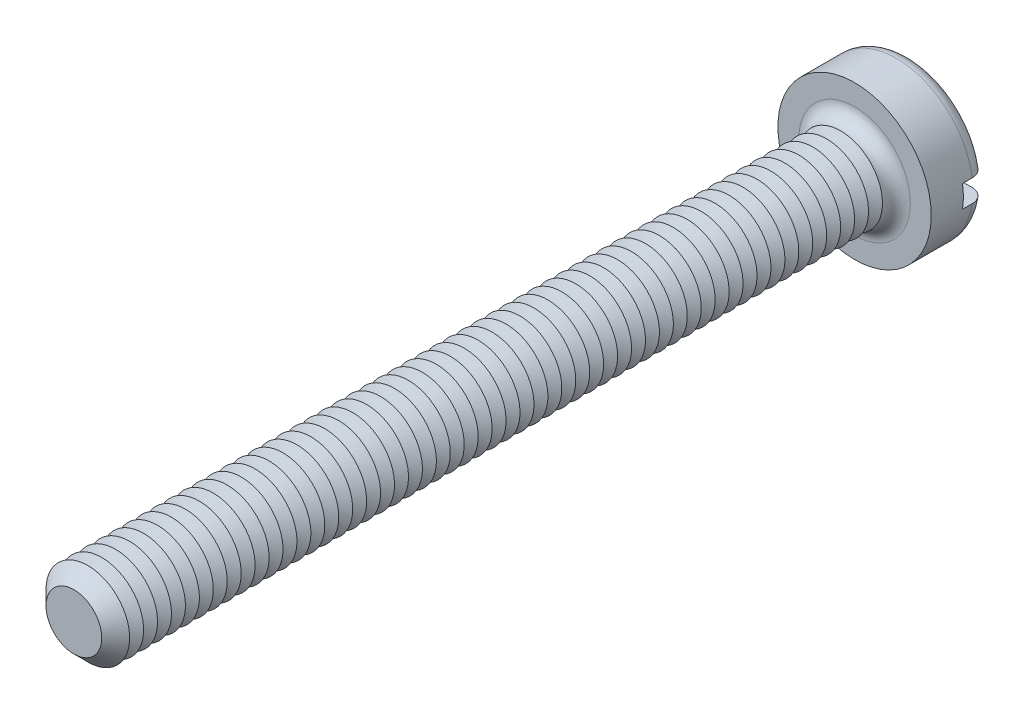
ISO-10303-21;
HEADER;
FILE_DESCRIPTION(('STEP AP214'),'2;1');
FILE_NAME('part.step','',(''),(''),'','','');
FILE_SCHEMA(('AUTOMOTIVE_DESIGN { 1 0 10303 214 1 1 1 1 }'));
ENDSEC;
DATA;
#1=APPLICATION_CONTEXT('core data for automotive mechanical design processes');
#2=APPLICATION_PROTOCOL_DEFINITION('international standard','automotive_design',2000,#1);
#3=PRODUCT_CONTEXT('',#1,'mechanical');
#4=PRODUCT('Part','Part','',(#3));
#5=PRODUCT_RELATED_PRODUCT_CATEGORY('part','',(#4));
#6=PRODUCT_DEFINITION_FORMATION('','',#4);
#7=PRODUCT_DEFINITION_CONTEXT('part definition',#1,'design');
#8=PRODUCT_DEFINITION('design','',#6,#7);
#9=PRODUCT_DEFINITION_SHAPE('','',#8);
#10=(LENGTH_UNIT() NAMED_UNIT(*) SI_UNIT(.MILLI.,.METRE.));
#11=(NAMED_UNIT(*) PLANE_ANGLE_UNIT() SI_UNIT($,.RADIAN.));
#12=(NAMED_UNIT(*) SI_UNIT($,.STERADIAN.) SOLID_ANGLE_UNIT());
#13=UNCERTAINTY_MEASURE_WITH_UNIT(LENGTH_MEASURE(1.E-05),#10,'distance_accuracy_value','');
#14=(GEOMETRIC_REPRESENTATION_CONTEXT(3) GLOBAL_UNCERTAINTY_ASSIGNED_CONTEXT((#13)) GLOBAL_UNIT_ASSIGNED_CONTEXT((#10,
#11,#12)) REPRESENTATION_CONTEXT('',''));
#15=CARTESIAN_POINT('',(0.,0.,0.));
#16=DIRECTION('',(0.,0.,1.));
#17=DIRECTION('',(1.,0.,0.));
#18=AXIS2_PLACEMENT_3D('',#15,#16,#17);
#19=CARTESIAN_POINT('',(0.,0.,-2.));
#20=DIRECTION('',(0.,0.,1.));
#21=DIRECTION('',(1.,0.,0.));
#22=AXIS2_PLACEMENT_3D('',#19,#20,#21);
#23=PLANE('',#22);
#24=CARTESIAN_POINT('',(0.,0.,-2.));
#25=DIRECTION('',(0.,0.,1.));
#26=DIRECTION('',(1.,0.,0.));
#27=AXIS2_PLACEMENT_3D('',#24,#25,#26);
#28=CIRCLE('',#27,2.25);
#29=CARTESIAN_POINT('',(-2.21415898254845,0.4,-2.));
#30=VERTEX_POINT('',#29);
#31=CARTESIAN_POINT('',(2.21415898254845,0.4,-2.));
#32=VERTEX_POINT('',#31);
#33=EDGE_CURVE('E116',#30,#32,#28,.F.);
#34=ORIENTED_EDGE('',*,*,#33,.T.);
#35=DIRECTION('',(1.,0.,0.));
#36=VECTOR('',#35,1.);
#37=CARTESIAN_POINT('',(-2.75,0.400000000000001,-2.));
#38=LINE('',#37,#36);
#39=EDGE_CURVE('E111',#30,#32,#38,.T.);
#40=ORIENTED_EDGE('',*,*,#39,.F.);
#41=EDGE_LOOP('',(#34,#40));
#42=FACE_BOUND('',#41,.T.);
#43=ADVANCED_FACE('F39',(#42),#23,.F.);
#44=CARTESIAN_POINT('',(0.,0.,-1.5));
#45=DIRECTION('',(0.,0.,1.));
#46=DIRECTION('',(1.,0.,0.));
#47=AXIS2_PLACEMENT_3D('',#44,#45,#46);
#48=TOROIDAL_SURFACE('',#47,2.25,0.5);
#49=CARTESIAN_POINT('',(-2.6296588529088,0.400000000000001,-1.78631483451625));
#50=CARTESIAN_POINT('',(-2.61332846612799,0.400000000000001,-1.80942627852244));
#51=CARTESIAN_POINT('',(-2.59501593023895,0.400000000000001,-1.83116426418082));
#52=CARTESIAN_POINT('',(-2.55497423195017,0.400000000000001,-1.87126271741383));
#53=CARTESIAN_POINT('',(-2.53324055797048,0.4,-1.88961865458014));
#54=CARTESIAN_POINT('',(-2.48702796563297,0.4,-1.92241505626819));
#55=CARTESIAN_POINT('',(-2.46255183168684,0.4,-1.93685944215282));
#56=CARTESIAN_POINT('',(-2.41154731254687,0.4,-1.96147315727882));
#57=CARTESIAN_POINT('',(-2.38501943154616,0.4,-1.97164353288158));
#58=CARTESIAN_POINT('',(-2.3303912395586,0.4,-1.98753780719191));
#59=CARTESIAN_POINT('',(-2.30227842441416,0.4,-1.99321871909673));
#60=CARTESIAN_POINT('',(-2.24549884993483,0.4,-1.99984170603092));
#61=CARTESIAN_POINT('',(-2.21683202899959,0.4,-2.00078325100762));
#62=CARTESIAN_POINT('',(-2.15939326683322,0.4,-1.99790249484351));
#63=CARTESIAN_POINT('',(-2.13062419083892,0.4,-1.99402290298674));
#64=CARTESIAN_POINT('',(-2.07413526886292,0.4,-1.98151915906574));
#65=CARTESIAN_POINT('',(-2.04641547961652,0.4,-1.97289475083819));
#66=CARTESIAN_POINT('',(-1.99264697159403,0.4,-1.95107177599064));
#67=CARTESIAN_POINT('',(-1.96660904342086,0.4,-1.93784659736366));
#68=CARTESIAN_POINT('',(-1.91713954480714,0.4,-1.90718730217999));
#69=CARTESIAN_POINT('',(-1.89370795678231,0.4,-1.88975321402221));
#70=CARTESIAN_POINT('',(-1.85029144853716,0.4,-1.85126548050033));
#71=CARTESIAN_POINT('',(-1.83028607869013,0.4,-1.83023492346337));
#72=CARTESIAN_POINT('',(-1.79417432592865,0.4,-1.78505552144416));
#73=CARTESIAN_POINT('',(-1.77806752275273,0.4,-1.76090701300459));
#74=CARTESIAN_POINT('',(-1.75056079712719,0.4,-1.71067721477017));
#75=CARTESIAN_POINT('',(-1.7390748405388,0.4,-1.68464306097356));
#76=CARTESIAN_POINT('',(-1.72075680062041,0.4,-1.63098625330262));
#77=CARTESIAN_POINT('',(-1.71392397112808,0.4,-1.60336385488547));
#78=CARTESIAN_POINT('',(-1.70525661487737,0.4,-1.54801066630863));
#79=CARTESIAN_POINT('',(-1.70330866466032,0.4,-1.52029759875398));
#80=CARTESIAN_POINT('',(-1.70414820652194,0.4,-1.46494458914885));
#81=CARTESIAN_POINT('',(-1.70693532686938,0.4,-1.43730464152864));
#82=CARTESIAN_POINT('',(-1.71709335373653,0.4,-1.38318389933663));
#83=CARTESIAN_POINT('',(-1.72441580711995,0.4,-1.35669397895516));
#84=CARTESIAN_POINT('',(-1.74335830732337,0.4,-1.30529964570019));
#85=CARTESIAN_POINT('',(-1.75497853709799,0.4,-1.2803953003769));
#86=CARTESIAN_POINT('',(-1.78229453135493,0.4,-1.23258298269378));
#87=CARTESIAN_POINT('',(-1.79803217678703,0.4,-1.20969896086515));
#88=CARTESIAN_POINT('',(-1.83304498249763,0.4,-1.16682064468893));
#89=CARTESIAN_POINT('',(-1.85232054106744,0.4,-1.1468266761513));
#90=CARTESIAN_POINT('',(-1.89433695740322,0.4,-1.10980713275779));
#91=CARTESIAN_POINT('',(-1.91714740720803,0.4,-1.09286053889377));
#92=CARTESIAN_POINT('',(-1.96524407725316,0.4,-1.06294809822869));
#93=CARTESIAN_POINT('',(-1.99053056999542,0.4,-1.04998269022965));
#94=CARTESIAN_POINT('',(-2.04340612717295,0.4,-1.02814800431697));
#95=CARTESIAN_POINT('',(-2.07103098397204,0.4,-1.01936532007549));
#96=CARTESIAN_POINT('',(-2.12735840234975,0.4,-1.00652373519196));
#97=CARTESIAN_POINT('',(-2.15606102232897,0.4,-1.00246509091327));
#98=CARTESIAN_POINT('',(-2.21395379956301,0.4,-0.999181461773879));
#99=CARTESIAN_POINT('',(-2.24314598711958,0.4,-0.999992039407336));
#100=CARTESIAN_POINT('',(-2.30097585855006,0.4,-1.00652779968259));
#101=CARTESIAN_POINT('',(-2.32961355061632,0.4,-1.01225290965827));
#102=CARTESIAN_POINT('',(-2.38536238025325,0.4,-1.02843951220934));
#103=CARTESIAN_POINT('',(-2.41248047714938,0.4,-1.03887701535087));
#104=CARTESIAN_POINT('',(-2.46454860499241,0.4,-1.06421009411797));
#105=CARTESIAN_POINT('',(-2.48949875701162,0.4,-1.0791054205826));
#106=CARTESIAN_POINT('',(-2.53620471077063,0.4,-1.11274531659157));
#107=CARTESIAN_POINT('',(-2.55799482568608,0.400000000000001,-1.1314422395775));
#108=CARTESIAN_POINT('',(-2.59807595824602,0.400000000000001,-1.17227176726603));
#109=CARTESIAN_POINT('',(-2.6163672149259,0.400000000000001,-1.19440413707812));
#110=CARTESIAN_POINT('',(-2.64868581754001,0.400000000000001,-1.24117072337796));
#111=CARTESIAN_POINT('',(-2.66276466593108,0.400000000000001,-1.26576935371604));
#112=CARTESIAN_POINT('',(-2.68654482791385,0.400000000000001,-1.31699754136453));
#113=CARTESIAN_POINT('',(-2.69624657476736,0.400000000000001,-1.34362689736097));
#114=CARTESIAN_POINT('',(-2.71090527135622,0.400000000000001,-1.39787706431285));
#115=CARTESIAN_POINT('',(-2.71590826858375,0.400000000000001,-1.4254854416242));
#116=CARTESIAN_POINT('',(-2.72118463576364,0.400000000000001,-1.48115803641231));
#117=CARTESIAN_POINT('',(-2.72145696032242,0.400000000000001,-1.50922235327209));
#118=CARTESIAN_POINT('',(-2.71727180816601,0.400000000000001,-1.56487271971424));
#119=CARTESIAN_POINT('',(-2.71283440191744,0.400000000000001,-1.59246029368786));
#120=CARTESIAN_POINT('',(-2.69939521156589,0.400000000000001,-1.64647499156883));
#121=CARTESIAN_POINT('',(-2.69039909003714,0.400000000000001,-1.67290351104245));
#122=CARTESIAN_POINT('',(-2.67251693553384,0.400000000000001,-1.71382731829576));
#123=CARTESIAN_POINT('',(-2.66497994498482,0.400000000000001,-1.72892686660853));
#124=CARTESIAN_POINT('',(-2.64841616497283,0.400000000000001,-1.75828509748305));
#125=CARTESIAN_POINT('',(-2.63938938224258,0.400000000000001,-1.77254378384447));
#126=CARTESIAN_POINT('',(-2.6296588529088,0.400000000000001,-1.78631483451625));
#127=B_SPLINE_CURVE_WITH_KNOTS('',3,(#49,#50,#51,#52,#53,#54,#55,#56,#57,#58,#59,#60,#61,#62,
#63,#64,#65,#66,#67,#68,#69,#70,#71,#72,#73,#74,#75,#76,#77,#78,#79,#80,#81,#82,#83,#84,#85,#86,
#87,#88,#89,#90,#91,#92,#93,#94,#95,#96,#97,#98,#99,#100,#101,#102,#103,#104,#105,#106,#107,
#108,#109,#110,#111,#112,#113,#114,#115,#116,#117,#118,#119,#120,#121,#122,#123,#124,#125,#126),
.UNSPECIFIED.,.T.,.F.,(4,2,2,2,2,2,2,2,2,2,2,2,2,2,2,2,2,2,2,2,2,2,2,2,2,2,2,2,2,2,2,2,2,2,2,2,
2,2,4),(0.,0.0848338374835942,0.16978050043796,0.254641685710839,0.339482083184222,
0.42512530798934,0.510778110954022,0.597458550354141,0.684143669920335,0.771338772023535,
0.858533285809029,0.945187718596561,1.03183280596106,1.11678035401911,1.20171427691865,
1.28465703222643,1.36759327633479,1.4496584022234,1.53172702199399,1.61466526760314,
1.69761285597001,1.78247103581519,1.86733856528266,1.95389396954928,2.0404540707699,
2.12764713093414,2.21483890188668,2.30159172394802,2.38833969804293,2.4740609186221,
2.55977628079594,2.6443962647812,2.72900787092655,2.81278135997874,2.89657336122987,
2.98000971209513,3.06334267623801,3.113891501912,3.16444009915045),.UNSPECIFIED.);
#128=CARTESIAN_POINT('',(-2.72075357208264,0.400000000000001,-1.50000000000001));
#129=VERTEX_POINT('',#128);
#130=EDGE_CURVE('E611',#129,#30,#127,.T.);
#131=ORIENTED_EDGE('',*,*,#130,.F.);
#132=CARTESIAN_POINT('',(0.,0.,-1.5));
#133=DIRECTION('',(0.,0.,1.));
#134=DIRECTION('',(1.,0.,0.));
#135=AXIS2_PLACEMENT_3D('',#132,#133,#134);
#136=CIRCLE('',#135,2.75);
#137=CARTESIAN_POINT('',(2.7207535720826,0.4,-1.5));
#138=VERTEX_POINT('',#137);
#139=EDGE_CURVE('E125',#138,#129,#136,.T.);
#140=ORIENTED_EDGE('',*,*,#139,.F.);
#141=CARTESIAN_POINT('',(1.7362507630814,0.4,-1.6752840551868));
#142=CARTESIAN_POINT('',(1.74636083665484,0.4,-1.70159961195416));
#143=CARTESIAN_POINT('',(1.7587429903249,0.4,-1.72706707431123));
#144=CARTESIAN_POINT('',(1.78764414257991,0.4,-1.77556609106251));
#145=CARTESIAN_POINT('',(1.80416918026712,0.4,-1.79859401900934));
#146=CARTESIAN_POINT('',(1.84080454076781,0.4,-1.84153587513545));
#147=CARTESIAN_POINT('',(1.86090949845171,0.4,-1.86145438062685));
#148=CARTESIAN_POINT('',(1.9041208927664,0.4,-1.89769607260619));
#149=CARTESIAN_POINT('',(1.92722659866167,0.4,-1.91402013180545));
#150=CARTESIAN_POINT('',(1.97620958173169,0.4,-1.94291288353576));
#151=CARTESIAN_POINT('',(2.00212726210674,0.4,-1.95541309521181));
#152=CARTESIAN_POINT('',(2.05567603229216,0.4,-1.97595143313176));
#153=CARTESIAN_POINT('',(2.08330733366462,0.4,-1.98398900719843));
#154=CARTESIAN_POINT('',(2.13989163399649,0.4,-1.99545904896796));
#155=CARTESIAN_POINT('',(2.16885726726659,0.4,-1.99882930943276));
#156=CARTESIAN_POINT('',(2.22694412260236,0.4,-2.00065872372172));
#157=CARTESIAN_POINT('',(2.25606534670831,0.4,-1.99911781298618));
#158=CARTESIAN_POINT('',(2.31362436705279,0.4,-1.99114818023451));
#159=CARTESIAN_POINT('',(2.34206235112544,0.4,-1.98472081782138));
#160=CARTESIAN_POINT('',(2.39743709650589,0.4,-1.96713601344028));
#161=CARTESIAN_POINT('',(2.42437392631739,0.4,-1.95597878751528));
#162=CARTESIAN_POINT('',(2.47569769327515,0.4,-1.92935960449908));
#163=CARTESIAN_POINT('',(2.50010686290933,0.4,-1.91394052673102));
#164=CARTESIAN_POINT('',(2.54594525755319,0.4,-1.8791725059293));
#165=CARTESIAN_POINT('',(2.56737468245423,0.4,-1.85982382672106));
#166=CARTESIAN_POINT('',(2.60634898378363,0.4,-1.81801641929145));
#167=CARTESIAN_POINT('',(2.6239407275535,0.4,-1.79560138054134));
#168=CARTESIAN_POINT('',(2.65505953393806,0.4,-1.7481077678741));
#169=CARTESIAN_POINT('',(2.66858686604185,0.4,-1.72302937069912));
#170=CARTESIAN_POINT('',(2.69103536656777,0.4,-1.67123055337));
#171=CARTESIAN_POINT('',(2.70000740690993,0.4,-1.64453217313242));
#172=CARTESIAN_POINT('',(2.71330608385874,0.4,-1.59000262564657));
#173=CARTESIAN_POINT('',(2.71763293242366,0.4,-1.5621715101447));
#174=CARTESIAN_POINT('',(2.72149675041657,0.4,-1.50637655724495));
#175=CARTESIAN_POINT('',(2.72106725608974,0.4,-1.47841503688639));
#176=CARTESIAN_POINT('',(2.7155123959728,0.4,-1.42296287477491));
#177=CARTESIAN_POINT('',(2.71038711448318,0.4,-1.39547222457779));
#178=CARTESIAN_POINT('',(2.69560462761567,0.4,-1.34178071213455));
#179=CARTESIAN_POINT('',(2.68595389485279,0.4,-1.31557806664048));
#180=CARTESIAN_POINT('',(2.66240876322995,0.4,-1.26515516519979));
#181=CARTESIAN_POINT('',(2.64851431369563,0.4,-1.24093493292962));
#182=CARTESIAN_POINT('',(2.61681930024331,0.4,-1.19504594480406));
#183=CARTESIAN_POINT('',(2.59900198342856,0.4,-1.17338876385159));
#184=CARTESIAN_POINT('',(2.56001495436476,0.4,-1.13333899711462));
#185=CARTESIAN_POINT('',(2.53884510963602,0.4,-1.11494654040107));
#186=CARTESIAN_POINT('',(2.49354554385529,0.4,-1.08175888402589));
#187=CARTESIAN_POINT('',(2.46938991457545,0.4,-1.06699905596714));
#188=CARTESIAN_POINT('',(2.41896725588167,0.4,-1.04168682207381));
#189=CARTESIAN_POINT('',(2.39270009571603,0.4,-1.03113467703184));
#190=CARTESIAN_POINT('',(2.33844927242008,0.4,-1.01439607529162));
#191=CARTESIAN_POINT('',(2.31044823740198,0.4,-1.00826592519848));
#192=CARTESIAN_POINT('',(2.25381752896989,0.4,-1.00073183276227));
#193=CARTESIAN_POINT('',(2.22518781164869,0.4,-0.999328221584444));
#194=CARTESIAN_POINT('',(2.16774231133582,0.4,-1.00127811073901));
#195=CARTESIAN_POINT('',(2.13892848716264,0.4,-1.00468955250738));
#196=CARTESIAN_POINT('',(2.08227193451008,0.4,-1.01626887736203));
#197=CARTESIAN_POINT('',(2.05442926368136,0.4,-1.02443704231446));
#198=CARTESIAN_POINT('',(2.00032604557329,0.4,-1.04537295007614));
#199=CARTESIAN_POINT('',(1.97407661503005,0.4,-1.05816944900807));
#200=CARTESIAN_POINT('',(1.92411255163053,0.4,-1.08801035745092));
#201=CARTESIAN_POINT('',(1.90039792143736,0.4,-1.10505477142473));
#202=CARTESIAN_POINT('',(1.85633574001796,0.4,-1.14282887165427));
#203=CARTESIAN_POINT('',(1.83597040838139,0.4,-1.16353779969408));
#204=CARTESIAN_POINT('',(1.79908731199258,0.4,-1.20813793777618));
#205=CARTESIAN_POINT('',(1.78256899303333,0.4,-1.23202868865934));
#206=CARTESIAN_POINT('',(1.75420022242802,0.4,-1.28183173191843));
#207=CARTESIAN_POINT('',(1.74226635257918,0.4,-1.30769648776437));
#208=CARTESIAN_POINT('',(1.72302798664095,0.4,-1.36110211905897));
#209=CARTESIAN_POINT('',(1.71572395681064,0.4,-1.38864316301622));
#210=CARTESIAN_POINT('',(1.70611974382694,0.4,-1.44392326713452));
#211=CARTESIAN_POINT('',(1.70370764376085,0.4,-1.47164298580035));
#212=CARTESIAN_POINT('',(1.70363822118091,0.4,-1.52706336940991));
#213=CARTESIAN_POINT('',(1.70597448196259,0.4,-1.55476400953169));
#214=CARTESIAN_POINT('',(1.71335146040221,0.4,-1.59796127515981));
#215=CARTESIAN_POINT('',(1.71686033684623,0.4,-1.61373520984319));
#216=CARTESIAN_POINT('',(1.7254146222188,0.4,-1.64486018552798));
#217=CARTESIAN_POINT('',(1.73045999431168,0.4,-1.66021123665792));
#218=CARTESIAN_POINT('',(1.7362507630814,0.4,-1.6752840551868));
#219=B_SPLINE_CURVE_WITH_KNOTS('',3,(#141,#142,#143,#144,#145,#146,#147,#148,#149,#150,#151,
#152,#153,#154,#155,#156,#157,#158,#159,#160,#161,#162,#163,#164,#165,#166,#167,#168,#169,#170,
#171,#172,#173,#174,#175,#176,#177,#178,#179,#180,#181,#182,#183,#184,#185,#186,#187,#188,#189,
#190,#191,#192,#193,#194,#195,#196,#197,#198,#199,#200,#201,#202,#203,#204,#205,#206,#207,#208,
#209,#210,#211,#212,#213,#214,#215,#216,#217,#218),.UNSPECIFIED.,.T.,.F.,(4,2,2,2,2,2,2,2,2,2,2,
2,2,2,2,2,2,2,2,2,2,2,2,2,2,2,2,2,2,2,2,2,2,2,2,2,2,2,4),(0.,0.0845117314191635,
0.169147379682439,0.253657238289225,0.338146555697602,0.424070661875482,0.510005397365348,
0.597074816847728,0.684145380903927,0.771191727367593,0.858234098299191,0.94443074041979,
1.03062159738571,1.11569223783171,1.20075723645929,1.28485012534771,1.36893917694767,
1.45243570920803,1.53593074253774,1.61930671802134,1.70268368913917,1.7864238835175,
1.87016738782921,1.95469664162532,2.03923113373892,2.12482389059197,2.21042264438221,
2.29706026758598,2.38370302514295,2.47089361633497,2.55808429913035,2.64479602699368,
2.73149525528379,2.81653234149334,2.9015779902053,2.98465497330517,3.06761976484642,
3.11602689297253,3.164432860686),.UNSPECIFIED.);
#220=EDGE_CURVE('E613',#32,#138,#219,.T.);
#221=ORIENTED_EDGE('',*,*,#220,.F.);
#222=ORIENTED_EDGE('',*,*,#33,.F.);
#223=EDGE_LOOP('',(#131,#140,#221,#222));
#224=FACE_BOUND('',#223,.T.);
#225=ADVANCED_FACE('F595',(#224),#48,.T.);
#226=CARTESIAN_POINT('',(0.,0.,-2.));
#227=DIRECTION('',(0.,0.,1.));
#228=DIRECTION('',(1.,0.,0.));
#229=AXIS2_PLACEMENT_3D('',#226,#227,#228);
#230=CYLINDRICAL_SURFACE('',#229,2.75);
#231=DIRECTION('',(0.,0.,1.));
#232=VECTOR('',#231,1.);
#233=CARTESIAN_POINT('',(2.72075357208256,0.4,-2.));
#234=LINE('',#233,#232);
#235=CARTESIAN_POINT('',(2.72075357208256,0.4,-1.15));
#236=VERTEX_POINT('',#235);
#237=EDGE_CURVE('E628',#138,#236,#234,.T.);
#238=ORIENTED_EDGE('',*,*,#237,.F.);
#239=ORIENTED_EDGE('',*,*,#139,.T.);
#240=DIRECTION('',(0.,0.,1.));
#241=VECTOR('',#240,1.);
#242=CARTESIAN_POINT('',(-2.72075357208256,0.4,-2.));
#243=LINE('',#242,#241);
#244=CARTESIAN_POINT('',(-2.72075357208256,0.4,-1.15));
#245=VERTEX_POINT('',#244);
#246=EDGE_CURVE('E63',#245,#129,#243,.F.);
#247=ORIENTED_EDGE('',*,*,#246,.F.);
#248=CARTESIAN_POINT('',(0.,0.,-1.15));
#249=DIRECTION('',(0.,0.,-1.));
#250=DIRECTION('',(-1.,0.,0.));
#251=AXIS2_PLACEMENT_3D('',#248,#249,#250);
#252=CIRCLE('',#251,2.75);
#253=CARTESIAN_POINT('',(-2.72075357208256,-0.4,-1.15));
#254=VERTEX_POINT('',#253);
#255=EDGE_CURVE('E43',#245,#254,#252,.F.);
#256=ORIENTED_EDGE('',*,*,#255,.T.);
#257=DIRECTION('',(0.,0.,1.));
#258=VECTOR('',#257,1.);
#259=CARTESIAN_POINT('',(-2.72075357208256,-0.4,-2.));
#260=LINE('',#259,#258);
#261=CARTESIAN_POINT('',(-2.72075357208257,-0.4,-1.5));
#262=VERTEX_POINT('',#261);
#263=EDGE_CURVE('E625',#262,#254,#260,.T.);
#264=ORIENTED_EDGE('',*,*,#263,.F.);
#265=CARTESIAN_POINT('',(2.72075357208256,-0.4,-1.5));
#266=VERTEX_POINT('',#265);
#267=EDGE_CURVE('E127',#262,#266,#136,.T.);
#268=ORIENTED_EDGE('',*,*,#267,.T.);
#269=DIRECTION('',(0.,0.,1.));
#270=VECTOR('',#269,1.);
#271=CARTESIAN_POINT('',(2.72075357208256,-0.4,-2.));
#272=LINE('',#271,#270);
#273=CARTESIAN_POINT('',(2.72075357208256,-0.4,-1.15));
#274=VERTEX_POINT('',#273);
#275=EDGE_CURVE('E55',#274,#266,#272,.F.);
#276=ORIENTED_EDGE('',*,*,#275,.F.);
#277=EDGE_CURVE('E11',#274,#236,#252,.F.);
#278=ORIENTED_EDGE('',*,*,#277,.T.);
#279=EDGE_LOOP('',(#238,#239,#247,#256,#264,#268,#276,#278));
#280=FACE_BOUND('',#279,.T.);
#281=CARTESIAN_POINT('',(0.,0.,0.));
#282=DIRECTION('',(0.,0.,1.));
#283=DIRECTION('',(1.,0.,0.));
#284=AXIS2_PLACEMENT_3D('',#281,#282,#283);
#285=CIRCLE('',#284,2.75);
#286=CARTESIAN_POINT('',(2.75,0.,0.));
#287=VERTEX_POINT('',#286);
#288=EDGE_CURVE('E631',#287,#287,#285,.T.);
#289=ORIENTED_EDGE('',*,*,#288,.F.);
#290=EDGE_LOOP('',(#289));
#291=FACE_BOUND('',#290,.T.);
#292=ADVANCED_FACE('F591',(#280,#291),#230,.T.);
#293=CARTESIAN_POINT('',(2.21415898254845,-0.4,-2.));
#294=VERTEX_POINT('',#293);
#295=CARTESIAN_POINT('',(-2.21415898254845,-0.4,-2.));
#296=VERTEX_POINT('',#295);
#297=EDGE_CURVE('E109',#294,#296,#28,.F.);
#298=ORIENTED_EDGE('',*,*,#297,.T.);
#299=DIRECTION('',(-1.,0.,0.));
#300=VECTOR('',#299,1.);
#301=CARTESIAN_POINT('',(-2.75,-0.4,-2.));
#302=LINE('',#301,#300);
#303=EDGE_CURVE('E96',#294,#296,#302,.T.);
#304=ORIENTED_EDGE('',*,*,#303,.F.);
#305=EDGE_LOOP('',(#298,#304));
#306=FACE_BOUND('',#305,.T.);
#307=ADVANCED_FACE('F108',(#306),#23,.F.);
#308=CARTESIAN_POINT('',(0.,0.,0.));
#309=DIRECTION('',(0.,0.,1.));
#310=DIRECTION('',(1.,0.,0.));
#311=AXIS2_PLACEMENT_3D('',#308,#309,#310);
#312=PLANE('',#311);
#313=CARTESIAN_POINT('',(0.,0.,0.));
#314=DIRECTION('',(0.,0.,1.));
#315=DIRECTION('',(1.,0.,0.));
#316=AXIS2_PLACEMENT_3D('',#313,#314,#315);
#317=CIRCLE('',#316,2.);
#318=CARTESIAN_POINT('',(2.,0.,0.));
#319=VERTEX_POINT('',#318);
#320=EDGE_CURVE('E115',#319,#319,#317,.F.);
#321=ORIENTED_EDGE('',*,*,#320,.T.);
#322=EDGE_LOOP('',(#321));
#323=FACE_BOUND('',#322,.T.);
#324=ORIENTED_EDGE('',*,*,#288,.T.);
#325=EDGE_LOOP('',(#324));
#326=FACE_BOUND('',#325,.T.);
#327=ADVANCED_FACE('F590',(#323,#326),#312,.T.);
#328=CARTESIAN_POINT('',(-2.6296588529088,-0.4,-1.78631483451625));
#329=CARTESIAN_POINT('',(-2.64575286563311,-0.4,-1.76353353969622));
#330=CARTESIAN_POINT('',(-2.65994473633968,-0.4,-1.73938506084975));
#331=CARTESIAN_POINT('',(-2.68408879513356,-0.4,-1.68903091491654));
#332=CARTESIAN_POINT('',(-2.69403633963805,-0.4,-1.6628230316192));
#333=CARTESIAN_POINT('',(-2.70937899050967,-0.4,-1.60911025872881));
#334=CARTESIAN_POINT('',(-2.71477511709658,-0.4,-1.5816056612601));
#335=CARTESIAN_POINT('',(-2.72085365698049,-0.4,-1.52608718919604));
#336=CARTESIAN_POINT('',(-2.7215371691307,-0.4,-1.49807343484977));
#337=CARTESIAN_POINT('',(-2.71817903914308,-0.4,-1.44242333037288));
#338=CARTESIAN_POINT('',(-2.71415291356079,-0.4,-1.41478604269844));
#339=CARTESIAN_POINT('',(-2.70152104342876,-0.4,-1.36057835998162));
#340=CARTESIAN_POINT('',(-2.69291517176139,-0.4,-1.33400799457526));
#341=CARTESIAN_POINT('',(-2.67137052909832,-0.4,-1.28266198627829));
#342=CARTESIAN_POINT('',(-2.65842829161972,-0.4,-1.25788779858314));
#343=CARTESIAN_POINT('',(-2.62859348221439,-0.4,-1.21084577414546));
#344=CARTESIAN_POINT('',(-2.61170082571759,-0.4,-1.18857799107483));
#345=CARTESIAN_POINT('',(-2.5743351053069,-0.4,-1.1470221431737));
#346=CARTESIAN_POINT('',(-2.55383974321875,-0.4,-1.12775413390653));
#347=CARTESIAN_POINT('',(-2.5099353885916,-0.4,-1.09288845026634));
#348=CARTESIAN_POINT('',(-2.48652625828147,-0.4,-1.07729094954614));
#349=CARTESIAN_POINT('',(-2.43718903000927,-0.4,-1.0500239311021));
#350=CARTESIAN_POINT('',(-2.41123629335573,-0.4,-1.0383990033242));
#351=CARTESIAN_POINT('',(-2.35776417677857,-0.4,-1.01960886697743));
#352=CARTESIAN_POINT('',(-2.33024469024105,-0.4,-1.01244396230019));
#353=CARTESIAN_POINT('',(-2.27404134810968,-0.4,-1.00268156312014));
#354=CARTESIAN_POINT('',(-2.24534705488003,-0.4,-1.00014414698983));
#355=CARTESIAN_POINT('',(-2.18793513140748,-0.4,-0.999867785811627));
#356=CARTESIAN_POINT('',(-2.15921749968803,-0.4,-1.00212917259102));
#357=CARTESIAN_POINT('',(-2.10225052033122,-0.4,-1.01142552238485));
#358=CARTESIAN_POINT('',(-2.07400941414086,-0.4,-1.01851105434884));
#359=CARTESIAN_POINT('',(-2.01911044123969,-0.4,-1.03730994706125));
#360=CARTESIAN_POINT('',(-1.99245264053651,-0.4,-1.04902350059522));
#361=CARTESIAN_POINT('',(-1.94142108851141,-0.4,-1.07679847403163));
#362=CARTESIAN_POINT('',(-1.91705303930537,-0.4,-1.09287038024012));
#363=CARTESIAN_POINT('',(-1.87139758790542,-0.4,-1.12891897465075));
#364=CARTESIAN_POINT('',(-1.85011007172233,-0.4,-1.14889551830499));
#365=CARTESIAN_POINT('',(-1.81149058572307,-0.4,-1.19196940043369));
#366=CARTESIAN_POINT('',(-1.79411779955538,-0.4,-1.21503011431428));
#367=CARTESIAN_POINT('',(-1.76359546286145,-0.4,-1.26379588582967));
#368=CARTESIAN_POINT('',(-1.75044532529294,-0.4,-1.28950057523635));
#369=CARTESIAN_POINT('',(-1.72906221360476,-0.4,-1.3422057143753));
#370=CARTESIAN_POINT('',(-1.72072512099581,-0.4,-1.3691639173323));
#371=CARTESIAN_POINT('',(-1.70880448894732,-0.4,-1.42411084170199));
#372=CARTESIAN_POINT('',(-1.7052202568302,-0.4,-1.45209941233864));
#373=CARTESIAN_POINT('',(-1.70295553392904,-0.4,-1.50768522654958));
#374=CARTESIAN_POINT('',(-1.70417398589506,-0.4,-1.53527840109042));
#375=CARTESIAN_POINT('',(-1.71124536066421,-0.4,-1.58986292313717));
#376=CARTESIAN_POINT('',(-1.71709811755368,-0.4,-1.61685429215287));
#377=CARTESIAN_POINT('',(-1.73321132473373,-0.4,-1.66938107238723));
#378=CARTESIAN_POINT('',(-1.74345625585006,-0.4,-1.69492125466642));
#379=CARTESIAN_POINT('',(-1.76802111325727,-0.4,-1.74395877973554));
#380=CARTESIAN_POINT('',(-1.78234133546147,-0.4,-1.76745597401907));
#381=CARTESIAN_POINT('',(-1.81488631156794,-0.4,-1.81216193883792));
#382=CARTESIAN_POINT('',(-1.83317116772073,-0.4,-1.83332693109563));
#383=CARTESIAN_POINT('',(-1.87296030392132,-0.4,-1.872375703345));
#384=CARTESIAN_POINT('',(-1.89446497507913,-0.4,-1.89025908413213));
#385=CARTESIAN_POINT('',(-1.94063077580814,-0.4,-1.92267732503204));
#386=CARTESIAN_POINT('',(-1.96535444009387,-0.4,-1.93712316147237));
#387=CARTESIAN_POINT('',(-2.01684705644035,-0.4,-1.96173690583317));
#388=CARTESIAN_POINT('',(-2.04361620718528,-0.4,-1.97190439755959));
#389=CARTESIAN_POINT('',(-2.09891021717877,-0.4,-1.9878230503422));
#390=CARTESIAN_POINT('',(-2.12745653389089,-0.4,-1.99349978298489));
#391=CARTESIAN_POINT('',(-2.18509639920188,-0.4,-1.99999556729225));
#392=CARTESIAN_POINT('',(-2.21418994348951,-0.4,-2.00081465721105));
#393=CARTESIAN_POINT('',(-2.27218032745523,-0.4,-1.99755156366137));
#394=CARTESIAN_POINT('',(-2.30107643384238,-0.4,-1.99345627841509));
#395=CARTESIAN_POINT('',(-2.35776697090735,-0.4,-1.98043125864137));
#396=CARTESIAN_POINT('',(-2.38556116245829,-0.4,-1.97150048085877));
#397=CARTESIAN_POINT('',(-2.43901832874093,-0.4,-1.94912081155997));
#398=CARTESIAN_POINT('',(-2.46469578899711,-0.4,-1.93570648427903));
#399=CARTESIAN_POINT('',(-2.51337022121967,-0.4,-1.90471183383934));
#400=CARTESIAN_POINT('',(-2.53637056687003,-0.4,-1.88713684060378));
#401=CARTESIAN_POINT('',(-2.57111030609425,-0.4,-1.85552084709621));
#402=CARTESIAN_POINT('',(-2.58386709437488,-0.4,-1.84257896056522));
#403=CARTESIAN_POINT('',(-2.60790410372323,-0.4,-1.81538935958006));
#404=CARTESIAN_POINT('',(-2.61918433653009,-0.4,-1.80114165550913));
#405=CARTESIAN_POINT('',(-2.6296588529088,-0.4,-1.78631483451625));
#406=B_SPLINE_CURVE_WITH_KNOTS('',3,(#328,#329,#330,#331,#332,#333,#334,#335,#336,#337,#338,
#339,#340,#341,#342,#343,#344,#345,#346,#347,#348,#349,#350,#351,#352,#353,#354,#355,#356,#357,
#358,#359,#360,#361,#362,#363,#364,#365,#366,#367,#368,#369,#370,#371,#372,#373,#374,#375,#376,
#377,#378,#379,#380,#381,#382,#383,#384,#385,#386,#387,#388,#389,#390,#391,#392,#393,#394,#395,
#396,#397,#398,#399,#400,#401,#402,#403,#404,#405),.UNSPECIFIED.,.T.,.F.,(4,2,2,2,2,2,2,2,2,2,2,
2,2,2,2,2,2,2,2,2,2,2,2,2,2,2,2,2,2,2,2,2,2,2,2,2,2,2,4),(0.,0.0836125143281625,
0.167316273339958,0.251001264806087,0.334666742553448,0.418057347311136,0.501450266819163,
0.584910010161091,0.668371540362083,0.752369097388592,0.836370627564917,0.921286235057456,
1.00620762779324,1.09222390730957,1.17824613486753,1.26518425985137,1.35212600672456,
1.43927882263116,1.52642841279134,1.61262232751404,1.69880425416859,1.7830443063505,
1.86727208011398,1.9497371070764,2.03219918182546,2.1143722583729,2.19655130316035,
2.28007615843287,2.36361116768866,2.44911836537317,2.53463387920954,2.62153862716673,
2.70844269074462,2.79557895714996,2.88273403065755,2.96923214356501,3.05562004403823,
3.11003826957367,3.16445606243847),.UNSPECIFIED.);
#407=EDGE_CURVE('E103',#296,#262,#406,.T.);
#408=ORIENTED_EDGE('',*,*,#407,.F.);
#409=ORIENTED_EDGE('',*,*,#297,.F.);
#410=CARTESIAN_POINT('',(1.7362507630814,-0.4,-1.6752840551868));
#411=CARTESIAN_POINT('',(1.72641416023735,-0.4,-1.64967314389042));
#412=CARTESIAN_POINT('',(1.71871480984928,-0.4,-1.62322216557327));
#413=CARTESIAN_POINT('',(1.70786038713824,-0.4,-1.56938399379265));
#414=CARTESIAN_POINT('',(1.70470970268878,-0.4,-1.54199592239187));
#415=CARTESIAN_POINT('',(1.70306971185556,-0.4,-1.48708393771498));
#416=CARTESIAN_POINT('',(1.70457942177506,-0.4,-1.45956005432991));
#417=CARTESIAN_POINT('',(1.71220670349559,-0.4,-1.40516538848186));
#418=CARTESIAN_POINT('',(1.71832341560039,-0.4,-1.3782944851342));
#419=CARTESIAN_POINT('',(1.73494792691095,-0.4,-1.32598312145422));
#420=CARTESIAN_POINT('',(1.74545076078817,-0.4,-1.30054108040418));
#421=CARTESIAN_POINT('',(1.77051013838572,-0.4,-1.25173932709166));
#422=CARTESIAN_POINT('',(1.7850670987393,-0.4,-1.22837982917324));
#423=CARTESIAN_POINT('',(1.81806903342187,-0.4,-1.1839775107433));
#424=CARTESIAN_POINT('',(1.8365752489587,-0.4,-1.16298023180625));
#425=CARTESIAN_POINT('',(1.87677669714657,-0.4,-1.1243010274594));
#426=CARTESIAN_POINT('',(1.89847230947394,-0.4,-1.10661949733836));
#427=CARTESIAN_POINT('',(1.94498854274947,-0.4,-1.07463966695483));
#428=CARTESIAN_POINT('',(1.96987078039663,-0.4,-1.06043095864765));
#429=CARTESIAN_POINT('',(2.02163980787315,-0.4,-1.0363161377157));
#430=CARTESIAN_POINT('',(2.04852678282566,-0.4,-1.02641042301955));
#431=CARTESIAN_POINT('',(2.10400319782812,-0.4,-1.01104128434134));
#432=CARTESIAN_POINT('',(2.13261287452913,-0.4,-1.00565079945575));
#433=CARTESIAN_POINT('',(2.19033179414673,-0.4,-0.999735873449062));
#434=CARTESIAN_POINT('',(2.2194410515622,-0.4,-0.999211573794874));
#435=CARTESIAN_POINT('',(2.27740442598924,-0.4,-1.00306591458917));
#436=CARTESIAN_POINT('',(2.30625777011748,-0.4,-1.00745623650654));
#437=CARTESIAN_POINT('',(2.36280530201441,-0.4,-1.02105937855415));
#438=CARTESIAN_POINT('',(2.39049952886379,-0.4,-1.03027203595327));
#439=CARTESIAN_POINT('',(2.44369359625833,-0.4,-1.05318710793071));
#440=CARTESIAN_POINT('',(2.46920965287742,-0.4,-1.0668518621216));
#441=CARTESIAN_POINT('',(2.51754507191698,-0.4,-1.09832423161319));
#442=CARTESIAN_POINT('',(2.54036461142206,-0.4,-1.11613157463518));
#443=CARTESIAN_POINT('',(2.58234752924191,-0.4,-1.15513986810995));
#444=CARTESIAN_POINT('',(2.601553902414,-0.4,-1.1762945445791));
#445=CARTESIAN_POINT('',(2.63609001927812,-0.4,-1.22156192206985));
#446=CARTESIAN_POINT('',(2.65142002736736,-0.4,-1.24567442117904));
#447=CARTESIAN_POINT('',(2.67757733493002,-0.4,-1.29585881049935));
#448=CARTESIAN_POINT('',(2.68845668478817,-0.4,-1.32190357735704));
#449=CARTESIAN_POINT('',(2.7056478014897,-0.4,-1.375459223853));
#450=CARTESIAN_POINT('',(2.71195980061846,-0.4,-1.40297002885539));
#451=CARTESIAN_POINT('',(2.71979288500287,-0.4,-1.45843707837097));
#452=CARTESIAN_POINT('',(2.72135241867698,-0.4,-1.48638789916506));
#453=CARTESIAN_POINT('',(2.71974298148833,-0.4,-1.54215266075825));
#454=CARTESIAN_POINT('',(2.71657412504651,-0.4,-1.56996660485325));
#455=CARTESIAN_POINT('',(2.70561779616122,-0.4,-1.62459191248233));
#456=CARTESIAN_POINT('',(2.69784258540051,-0.4,-1.65140573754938));
#457=CARTESIAN_POINT('',(2.6779146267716,-0.4,-1.70335337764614));
#458=CARTESIAN_POINT('',(2.66576185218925,-0.4,-1.72848718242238));
#459=CARTESIAN_POINT('',(2.63739107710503,-0.4,-1.77645196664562));
#460=CARTESIAN_POINT('',(2.62116029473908,-0.4,-1.79927538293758));
#461=CARTESIAN_POINT('',(2.58512700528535,-0.4,-1.84190182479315));
#462=CARTESIAN_POINT('',(2.56532438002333,-0.4,-1.86170475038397));
#463=CARTESIAN_POINT('',(2.522535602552,-0.4,-1.89791219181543));
#464=CARTESIAN_POINT('',(2.49952399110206,-0.4,-1.91428661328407));
#465=CARTESIAN_POINT('',(2.45110500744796,-0.4,-1.94299324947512));
#466=CARTESIAN_POINT('',(2.4256974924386,-0.4,-1.95532522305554));
#467=CARTESIAN_POINT('',(2.37288090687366,-0.4,-1.97575769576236));
#468=CARTESIAN_POINT('',(2.34545135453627,-0.4,-1.98380524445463));
#469=CARTESIAN_POINT('',(2.28963821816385,-0.4,-1.99524443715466));
#470=CARTESIAN_POINT('',(2.26125456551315,-0.4,-1.99863574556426));
#471=CARTESIAN_POINT('',(2.20395671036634,-0.4,-2.00070487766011));
#472=CARTESIAN_POINT('',(2.17504033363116,-0.4,-1.99932265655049));
#473=CARTESIAN_POINT('',(2.11784130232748,-0.4,-1.9917648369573));
#474=CARTESIAN_POINT('',(2.08955866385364,-0.4,-1.98558911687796));
#475=CARTESIAN_POINT('',(2.03419451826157,-0.4,-1.96854979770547));
#476=CARTESIAN_POINT('',(2.00712437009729,-0.4,-1.95764925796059));
#477=CARTESIAN_POINT('',(1.95519572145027,-0.4,-1.93144413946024));
#478=CARTESIAN_POINT('',(1.93033780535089,-0.4,-1.91613840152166));
#479=CARTESIAN_POINT('',(1.88362525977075,-0.4,-1.88157419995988));
#480=CARTESIAN_POINT('',(1.86176428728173,-0.4,-1.86232430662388));
#481=CARTESIAN_POINT('',(1.82167218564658,-0.4,-1.82038600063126));
#482=CARTESIAN_POINT('',(1.803436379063,-0.4,-1.7977020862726));
#483=CARTESIAN_POINT('',(1.77700088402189,-0.4,-1.7582526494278));
#484=CARTESIAN_POINT('',(1.7675549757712,-0.4,-1.74230781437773));
#485=CARTESIAN_POINT('',(1.75049861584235,-0.4,-1.70946415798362));
#486=CARTESIAN_POINT('',(1.7428881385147,-0.4,-1.69256534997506));
#487=CARTESIAN_POINT('',(1.7362507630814,-0.4,-1.6752840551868));
#488=B_SPLINE_CURVE_WITH_KNOTS('',3,(#410,#411,#412,#413,#414,#415,#416,#417,#418,#419,#420,
#421,#422,#423,#424,#425,#426,#427,#428,#429,#430,#431,#432,#433,#434,#435,#436,#437,#438,#439,
#440,#441,#442,#443,#444,#445,#446,#447,#448,#449,#450,#451,#452,#453,#454,#455,#456,#457,#458,
#459,#460,#461,#462,#463,#464,#465,#466,#467,#468,#469,#470,#471,#472,#473,#474,#475,#476,#477,
#478,#479,#480,#481,#482,#483,#484,#485,#486,#487),.UNSPECIFIED.,.T.,.F.,(4,2,2,2,2,2,2,2,2,2,2,
2,2,2,2,2,2,2,2,2,2,2,2,2,2,2,2,2,2,2,2,2,2,2,2,2,2,2,4),(0.,0.0822382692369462,
0.164555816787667,0.246855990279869,0.329140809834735,0.411332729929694,0.493533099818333,
0.577115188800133,0.660707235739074,0.746270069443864,0.831840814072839,0.918768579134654,
1.00569887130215,1.09283622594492,1.17997064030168,1.26638632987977,1.35279634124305,
1.43810213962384,1.52340211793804,1.60767384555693,1.69194128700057,1.77552515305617,
1.85910699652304,1.94246734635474,2.02582820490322,2.10945367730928,2.19308191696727,
2.2774160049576,2.36175512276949,2.4471137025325,2.53247843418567,2.61892083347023,
2.70536542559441,2.79249842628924,2.87965437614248,2.96662291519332,3.05347850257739,
3.10897061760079,3.16446195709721),.UNSPECIFIED.);
#489=EDGE_CURVE('E92',#266,#294,#488,.T.);
#490=ORIENTED_EDGE('',*,*,#489,.F.);
#491=ORIENTED_EDGE('',*,*,#267,.F.);
#492=EDGE_LOOP('',(#408,#409,#490,#491));
#493=FACE_BOUND('',#492,.T.);
#494=ADVANCED_FACE('F113',(#493),#48,.T.);
#495=CARTESIAN_POINT('',(0.,0.,0.5));
#496=DIRECTION('',(0.,0.,1.));
#497=DIRECTION('',(1.,0.,0.));
#498=AXIS2_PLACEMENT_3D('',#495,#496,#497);
#499=TOROIDAL_SURFACE('',#498,2.,0.5);
#500=ORIENTED_EDGE('',*,*,#320,.F.);
#501=EDGE_LOOP('',(#500));
#502=FACE_BOUND('',#501,.T.);
#503=CARTESIAN_POINT('',(0.,0.,0.5));
#504=DIRECTION('',(0.,0.,-1.));
#505=DIRECTION('',(-1.,0.,0.));
#506=AXIS2_PLACEMENT_3D('',#503,#504,#505);
#507=CIRCLE('',#506,1.5);
#508=CARTESIAN_POINT('',(-1.5,0.,0.5));
#509=VERTEX_POINT('',#508);
#510=EDGE_CURVE('E636',#509,#509,#507,.T.);
#511=ORIENTED_EDGE('',*,*,#510,.T.);
#512=EDGE_LOOP('',(#511));
#513=FACE_BOUND('',#512,.T.);
#514=ADVANCED_FACE('F583',(#502,#513),#499,.F.);
#515=CARTESIAN_POINT('',(0.,0.,0.750000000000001));
#516=DIRECTION('',(0.,0.,-1.));
#517=DIRECTION('',(-1.,0.,0.));
#518=AXIS2_PLACEMENT_3D('',#515,#516,#517);
#519=CONICAL_SURFACE('',#518,1.06698729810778,1.0471975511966);
#520=ORIENTED_EDGE('',*,*,#510,.F.);
#521=EDGE_LOOP('',(#520));
#522=FACE_BOUND('',#521,.T.);
#523=CARTESIAN_POINT('',(0.,0.,0.750000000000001));
#524=DIRECTION('',(0.,0.,-1.));
#525=DIRECTION('',(-1.,0.,0.));
#526=AXIS2_PLACEMENT_3D('',#523,#524,#525);
#527=CIRCLE('',#526,1.06698729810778);
#528=CARTESIAN_POINT('',(-1.06698729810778,0.,0.750000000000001));
#529=VERTEX_POINT('',#528);
#530=EDGE_CURVE('E642',#529,#529,#527,.T.);
#531=ORIENTED_EDGE('',*,*,#530,.T.);
#532=EDGE_LOOP('',(#531));
#533=FACE_BOUND('',#532,.T.);
#534=ADVANCED_FACE('F579',(#522,#533),#519,.T.);
#535=CARTESIAN_POINT('',(0.,0.,1.));
#536=DIRECTION('',(0.,0.,1.));
#537=DIRECTION('',(1.,0.,0.));
#538=AXIS2_PLACEMENT_3D('',#535,#536,#537);
#539=CONICAL_SURFACE('',#538,1.5,1.0471975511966);
#540=ORIENTED_EDGE('',*,*,#530,.F.);
#541=EDGE_LOOP('',(#540));
#542=FACE_BOUND('',#541,.T.);
#543=CARTESIAN_POINT('',(0.,0.,1.));
#544=DIRECTION('',(0.,0.,-1.));
#545=DIRECTION('',(-1.,0.,0.));
#546=AXIS2_PLACEMENT_3D('',#543,#544,#545);
#547=CIRCLE('',#546,1.5);
#548=CARTESIAN_POINT('',(-1.5,0.,1.));
#549=VERTEX_POINT('',#548);
#550=EDGE_CURVE('E648',#549,#549,#547,.T.);
#551=ORIENTED_EDGE('',*,*,#550,.T.);
#552=EDGE_LOOP('',(#551));
#553=FACE_BOUND('',#552,.T.);
#554=ADVANCED_FACE('F575',(#542,#553),#539,.T.);
#555=CARTESIAN_POINT('',(0.,0.,1.25));
#556=DIRECTION('',(0.,0.,-1.));
#557=DIRECTION('',(-1.,0.,0.));
#558=AXIS2_PLACEMENT_3D('',#555,#556,#557);
#559=CONICAL_SURFACE('',#558,1.06698729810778,1.0471975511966);
#560=ORIENTED_EDGE('',*,*,#550,.F.);
#561=EDGE_LOOP('',(#560));
#562=FACE_BOUND('',#561,.T.);
#563=CARTESIAN_POINT('',(0.,0.,1.25));
#564=DIRECTION('',(0.,0.,-1.));
#565=DIRECTION('',(-1.,0.,0.));
#566=AXIS2_PLACEMENT_3D('',#563,#564,#565);
#567=CIRCLE('',#566,1.06698729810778);
#568=CARTESIAN_POINT('',(-1.06698729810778,0.,1.25));
#569=VERTEX_POINT('',#568);
#570=EDGE_CURVE('E652',#569,#569,#567,.T.);
#571=ORIENTED_EDGE('',*,*,#570,.T.);
#572=EDGE_LOOP('',(#571));
#573=FACE_BOUND('',#572,.T.);
#574=ADVANCED_FACE('F571',(#562,#573),#559,.T.);
#575=CARTESIAN_POINT('',(0.,0.,1.5));
#576=DIRECTION('',(0.,0.,1.));
#577=DIRECTION('',(1.,0.,0.));
#578=AXIS2_PLACEMENT_3D('',#575,#576,#577);
#579=CONICAL_SURFACE('',#578,1.5,1.0471975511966);
#580=ORIENTED_EDGE('',*,*,#570,.F.);
#581=EDGE_LOOP('',(#580));
#582=FACE_BOUND('',#581,.T.);
#583=CARTESIAN_POINT('',(0.,0.,1.5));
#584=DIRECTION('',(0.,0.,-1.));
#585=DIRECTION('',(-1.,0.,0.));
#586=AXIS2_PLACEMENT_3D('',#583,#584,#585);
#587=CIRCLE('',#586,1.5);
#588=CARTESIAN_POINT('',(-1.5,0.,1.5));
#589=VERTEX_POINT('',#588);
#590=EDGE_CURVE('E656',#589,#589,#587,.T.);
#591=ORIENTED_EDGE('',*,*,#590,.T.);
#592=EDGE_LOOP('',(#591));
#593=FACE_BOUND('',#592,.T.);
#594=ADVANCED_FACE('F567',(#582,#593),#579,.T.);
#595=CARTESIAN_POINT('',(0.,0.,1.75));
#596=DIRECTION('',(0.,0.,-1.));
#597=DIRECTION('',(-1.,0.,0.));
#598=AXIS2_PLACEMENT_3D('',#595,#596,#597);
#599=CONICAL_SURFACE('',#598,1.06698729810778,1.0471975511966);
#600=ORIENTED_EDGE('',*,*,#590,.F.);
#601=EDGE_LOOP('',(#600));
#602=FACE_BOUND('',#601,.T.);
#603=CARTESIAN_POINT('',(0.,0.,1.75));
#604=DIRECTION('',(0.,0.,-1.));
#605=DIRECTION('',(-1.,0.,0.));
#606=AXIS2_PLACEMENT_3D('',#603,#604,#605);
#607=CIRCLE('',#606,1.06698729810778);
#608=CARTESIAN_POINT('',(-1.06698729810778,0.,1.75));
#609=VERTEX_POINT('',#608);
#610=EDGE_CURVE('E660',#609,#609,#607,.T.);
#611=ORIENTED_EDGE('',*,*,#610,.T.);
#612=EDGE_LOOP('',(#611));
#613=FACE_BOUND('',#612,.T.);
#614=ADVANCED_FACE('F563',(#602,#613),#599,.T.);
#615=CARTESIAN_POINT('',(0.,0.,2.));
#616=DIRECTION('',(0.,0.,1.));
#617=DIRECTION('',(1.,0.,0.));
#618=AXIS2_PLACEMENT_3D('',#615,#616,#617);
#619=CONICAL_SURFACE('',#618,1.5,1.0471975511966);
#620=ORIENTED_EDGE('',*,*,#610,.F.);
#621=EDGE_LOOP('',(#620));
#622=FACE_BOUND('',#621,.T.);
#623=CARTESIAN_POINT('',(0.,0.,2.));
#624=DIRECTION('',(0.,0.,-1.));
#625=DIRECTION('',(-1.,0.,0.));
#626=AXIS2_PLACEMENT_3D('',#623,#624,#625);
#627=CIRCLE('',#626,1.5);
#628=CARTESIAN_POINT('',(-1.5,0.,2.));
#629=VERTEX_POINT('',#628);
#630=EDGE_CURVE('E664',#629,#629,#627,.T.);
#631=ORIENTED_EDGE('',*,*,#630,.T.);
#632=EDGE_LOOP('',(#631));
#633=FACE_BOUND('',#632,.T.);
#634=ADVANCED_FACE('F559',(#622,#633),#619,.T.);
#635=CARTESIAN_POINT('',(0.,0.,2.25));
#636=DIRECTION('',(0.,0.,-1.));
#637=DIRECTION('',(-1.,0.,0.));
#638=AXIS2_PLACEMENT_3D('',#635,#636,#637);
#639=CONICAL_SURFACE('',#638,1.06698729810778,1.0471975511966);
#640=ORIENTED_EDGE('',*,*,#630,.F.);
#641=EDGE_LOOP('',(#640));
#642=FACE_BOUND('',#641,.T.);
#643=CARTESIAN_POINT('',(0.,0.,2.25));
#644=DIRECTION('',(0.,0.,-1.));
#645=DIRECTION('',(-1.,0.,0.));
#646=AXIS2_PLACEMENT_3D('',#643,#644,#645);
#647=CIRCLE('',#646,1.06698729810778);
#648=CARTESIAN_POINT('',(-1.06698729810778,0.,2.25));
#649=VERTEX_POINT('',#648);
#650=EDGE_CURVE('E668',#649,#649,#647,.T.);
#651=ORIENTED_EDGE('',*,*,#650,.T.);
#652=EDGE_LOOP('',(#651));
#653=FACE_BOUND('',#652,.T.);
#654=ADVANCED_FACE('F555',(#642,#653),#639,.T.);
#655=CARTESIAN_POINT('',(0.,0.,2.5));
#656=DIRECTION('',(0.,0.,1.));
#657=DIRECTION('',(1.,0.,0.));
#658=AXIS2_PLACEMENT_3D('',#655,#656,#657);
#659=CONICAL_SURFACE('',#658,1.5,1.0471975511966);
#660=ORIENTED_EDGE('',*,*,#650,.F.);
#661=EDGE_LOOP('',(#660));
#662=FACE_BOUND('',#661,.T.);
#663=CARTESIAN_POINT('',(0.,0.,2.5));
#664=DIRECTION('',(0.,0.,-1.));
#665=DIRECTION('',(-1.,0.,0.));
#666=AXIS2_PLACEMENT_3D('',#663,#664,#665);
#667=CIRCLE('',#666,1.5);
#668=CARTESIAN_POINT('',(-1.5,0.,2.5));
#669=VERTEX_POINT('',#668);
#670=EDGE_CURVE('E672',#669,#669,#667,.T.);
#671=ORIENTED_EDGE('',*,*,#670,.T.);
#672=EDGE_LOOP('',(#671));
#673=FACE_BOUND('',#672,.T.);
#674=ADVANCED_FACE('F551',(#662,#673),#659,.T.);
#675=CARTESIAN_POINT('',(0.,0.,2.75));
#676=DIRECTION('',(0.,0.,-1.));
#677=DIRECTION('',(-1.,0.,0.));
#678=AXIS2_PLACEMENT_3D('',#675,#676,#677);
#679=CONICAL_SURFACE('',#678,1.06698729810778,1.0471975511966);
#680=ORIENTED_EDGE('',*,*,#670,.F.);
#681=EDGE_LOOP('',(#680));
#682=FACE_BOUND('',#681,.T.);
#683=CARTESIAN_POINT('',(0.,0.,2.75));
#684=DIRECTION('',(0.,0.,-1.));
#685=DIRECTION('',(-1.,0.,0.));
#686=AXIS2_PLACEMENT_3D('',#683,#684,#685);
#687=CIRCLE('',#686,1.06698729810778);
#688=CARTESIAN_POINT('',(-1.06698729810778,0.,2.75));
#689=VERTEX_POINT('',#688);
#690=EDGE_CURVE('E676',#689,#689,#687,.T.);
#691=ORIENTED_EDGE('',*,*,#690,.T.);
#692=EDGE_LOOP('',(#691));
#693=FACE_BOUND('',#692,.T.);
#694=ADVANCED_FACE('F547',(#682,#693),#679,.T.);
#695=CARTESIAN_POINT('',(0.,0.,3.));
#696=DIRECTION('',(0.,0.,1.));
#697=DIRECTION('',(1.,0.,0.));
#698=AXIS2_PLACEMENT_3D('',#695,#696,#697);
#699=CONICAL_SURFACE('',#698,1.5,1.0471975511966);
#700=ORIENTED_EDGE('',*,*,#690,.F.);
#701=EDGE_LOOP('',(#700));
#702=FACE_BOUND('',#701,.T.);
#703=CARTESIAN_POINT('',(0.,0.,3.));
#704=DIRECTION('',(0.,0.,-1.));
#705=DIRECTION('',(-1.,0.,0.));
#706=AXIS2_PLACEMENT_3D('',#703,#704,#705);
#707=CIRCLE('',#706,1.5);
#708=CARTESIAN_POINT('',(-1.5,0.,3.));
#709=VERTEX_POINT('',#708);
#710=EDGE_CURVE('E680',#709,#709,#707,.T.);
#711=ORIENTED_EDGE('',*,*,#710,.T.);
#712=EDGE_LOOP('',(#711));
#713=FACE_BOUND('',#712,.T.);
#714=ADVANCED_FACE('F543',(#702,#713),#699,.T.);
#715=CARTESIAN_POINT('',(0.,0.,3.25));
#716=DIRECTION('',(0.,0.,-1.));
#717=DIRECTION('',(-1.,0.,0.));
#718=AXIS2_PLACEMENT_3D('',#715,#716,#717);
#719=CONICAL_SURFACE('',#718,1.06698729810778,1.0471975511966);
#720=ORIENTED_EDGE('',*,*,#710,.F.);
#721=EDGE_LOOP('',(#720));
#722=FACE_BOUND('',#721,.T.);
#723=CARTESIAN_POINT('',(0.,0.,3.25));
#724=DIRECTION('',(0.,0.,-1.));
#725=DIRECTION('',(-1.,0.,0.));
#726=AXIS2_PLACEMENT_3D('',#723,#724,#725);
#727=CIRCLE('',#726,1.06698729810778);
#728=CARTESIAN_POINT('',(-1.06698729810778,0.,3.25));
#729=VERTEX_POINT('',#728);
#730=EDGE_CURVE('E684',#729,#729,#727,.T.);
#731=ORIENTED_EDGE('',*,*,#730,.T.);
#732=EDGE_LOOP('',(#731));
#733=FACE_BOUND('',#732,.T.);
#734=ADVANCED_FACE('F539',(#722,#733),#719,.T.);
#735=CARTESIAN_POINT('',(0.,0.,3.5));
#736=DIRECTION('',(0.,0.,1.));
#737=DIRECTION('',(1.,0.,0.));
#738=AXIS2_PLACEMENT_3D('',#735,#736,#737);
#739=CONICAL_SURFACE('',#738,1.5,1.0471975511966);
#740=ORIENTED_EDGE('',*,*,#730,.F.);
#741=EDGE_LOOP('',(#740));
#742=FACE_BOUND('',#741,.T.);
#743=CARTESIAN_POINT('',(0.,0.,3.5));
#744=DIRECTION('',(0.,0.,-1.));
#745=DIRECTION('',(-1.,0.,0.));
#746=AXIS2_PLACEMENT_3D('',#743,#744,#745);
#747=CIRCLE('',#746,1.5);
#748=CARTESIAN_POINT('',(-1.5,0.,3.5));
#749=VERTEX_POINT('',#748);
#750=EDGE_CURVE('E688',#749,#749,#747,.T.);
#751=ORIENTED_EDGE('',*,*,#750,.T.);
#752=EDGE_LOOP('',(#751));
#753=FACE_BOUND('',#752,.T.);
#754=ADVANCED_FACE('F535',(#742,#753),#739,.T.);
#755=CARTESIAN_POINT('',(0.,0.,3.75));
#756=DIRECTION('',(0.,0.,-1.));
#757=DIRECTION('',(-1.,0.,0.));
#758=AXIS2_PLACEMENT_3D('',#755,#756,#757);
#759=CONICAL_SURFACE('',#758,1.06698729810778,1.0471975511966);
#760=ORIENTED_EDGE('',*,*,#750,.F.);
#761=EDGE_LOOP('',(#760));
#762=FACE_BOUND('',#761,.T.);
#763=CARTESIAN_POINT('',(0.,0.,3.75));
#764=DIRECTION('',(0.,0.,-1.));
#765=DIRECTION('',(-1.,0.,0.));
#766=AXIS2_PLACEMENT_3D('',#763,#764,#765);
#767=CIRCLE('',#766,1.06698729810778);
#768=CARTESIAN_POINT('',(-1.06698729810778,0.,3.75));
#769=VERTEX_POINT('',#768);
#770=EDGE_CURVE('E692',#769,#769,#767,.T.);
#771=ORIENTED_EDGE('',*,*,#770,.T.);
#772=EDGE_LOOP('',(#771));
#773=FACE_BOUND('',#772,.T.);
#774=ADVANCED_FACE('F531',(#762,#773),#759,.T.);
#775=CARTESIAN_POINT('',(0.,0.,4.));
#776=DIRECTION('',(0.,0.,1.));
#777=DIRECTION('',(1.,0.,0.));
#778=AXIS2_PLACEMENT_3D('',#775,#776,#777);
#779=CONICAL_SURFACE('',#778,1.5,1.0471975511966);
#780=ORIENTED_EDGE('',*,*,#770,.F.);
#781=EDGE_LOOP('',(#780));
#782=FACE_BOUND('',#781,.T.);
#783=CARTESIAN_POINT('',(0.,0.,4.));
#784=DIRECTION('',(0.,0.,-1.));
#785=DIRECTION('',(-1.,0.,0.));
#786=AXIS2_PLACEMENT_3D('',#783,#784,#785);
#787=CIRCLE('',#786,1.5);
#788=CARTESIAN_POINT('',(-1.5,0.,4.));
#789=VERTEX_POINT('',#788);
#790=EDGE_CURVE('E696',#789,#789,#787,.T.);
#791=ORIENTED_EDGE('',*,*,#790,.T.);
#792=EDGE_LOOP('',(#791));
#793=FACE_BOUND('',#792,.T.);
#794=ADVANCED_FACE('F527',(#782,#793),#779,.T.);
#795=CARTESIAN_POINT('',(0.,0.,4.25));
#796=DIRECTION('',(0.,0.,-1.));
#797=DIRECTION('',(-1.,0.,0.));
#798=AXIS2_PLACEMENT_3D('',#795,#796,#797);
#799=CONICAL_SURFACE('',#798,1.06698729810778,1.0471975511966);
#800=ORIENTED_EDGE('',*,*,#790,.F.);
#801=EDGE_LOOP('',(#800));
#802=FACE_BOUND('',#801,.T.);
#803=CARTESIAN_POINT('',(0.,0.,4.25));
#804=DIRECTION('',(0.,0.,-1.));
#805=DIRECTION('',(-1.,0.,0.));
#806=AXIS2_PLACEMENT_3D('',#803,#804,#805);
#807=CIRCLE('',#806,1.06698729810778);
#808=CARTESIAN_POINT('',(-1.06698729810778,0.,4.25));
#809=VERTEX_POINT('',#808);
#810=EDGE_CURVE('E700',#809,#809,#807,.T.);
#811=ORIENTED_EDGE('',*,*,#810,.T.);
#812=EDGE_LOOP('',(#811));
#813=FACE_BOUND('',#812,.T.);
#814=ADVANCED_FACE('F523',(#802,#813),#799,.T.);
#815=CARTESIAN_POINT('',(0.,0.,4.5));
#816=DIRECTION('',(0.,0.,1.));
#817=DIRECTION('',(1.,0.,0.));
#818=AXIS2_PLACEMENT_3D('',#815,#816,#817);
#819=CONICAL_SURFACE('',#818,1.5,1.0471975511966);
#820=ORIENTED_EDGE('',*,*,#810,.F.);
#821=EDGE_LOOP('',(#820));
#822=FACE_BOUND('',#821,.T.);
#823=CARTESIAN_POINT('',(0.,0.,4.5));
#824=DIRECTION('',(0.,0.,-1.));
#825=DIRECTION('',(-1.,0.,0.));
#826=AXIS2_PLACEMENT_3D('',#823,#824,#825);
#827=CIRCLE('',#826,1.5);
#828=CARTESIAN_POINT('',(-1.5,0.,4.5));
#829=VERTEX_POINT('',#828);
#830=EDGE_CURVE('E704',#829,#829,#827,.T.);
#831=ORIENTED_EDGE('',*,*,#830,.T.);
#832=EDGE_LOOP('',(#831));
#833=FACE_BOUND('',#832,.T.);
#834=ADVANCED_FACE('F519',(#822,#833),#819,.T.);
#835=CARTESIAN_POINT('',(0.,0.,4.75));
#836=DIRECTION('',(0.,0.,-1.));
#837=DIRECTION('',(-1.,0.,0.));
#838=AXIS2_PLACEMENT_3D('',#835,#836,#837);
#839=CONICAL_SURFACE('',#838,1.06698729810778,1.0471975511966);
#840=ORIENTED_EDGE('',*,*,#830,.F.);
#841=EDGE_LOOP('',(#840));
#842=FACE_BOUND('',#841,.T.);
#843=CARTESIAN_POINT('',(0.,0.,4.75));
#844=DIRECTION('',(0.,0.,-1.));
#845=DIRECTION('',(-1.,0.,0.));
#846=AXIS2_PLACEMENT_3D('',#843,#844,#845);
#847=CIRCLE('',#846,1.06698729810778);
#848=CARTESIAN_POINT('',(-1.06698729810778,0.,4.75));
#849=VERTEX_POINT('',#848);
#850=EDGE_CURVE('E708',#849,#849,#847,.T.);
#851=ORIENTED_EDGE('',*,*,#850,.T.);
#852=EDGE_LOOP('',(#851));
#853=FACE_BOUND('',#852,.T.);
#854=ADVANCED_FACE('F515',(#842,#853),#839,.T.);
#855=CARTESIAN_POINT('',(0.,0.,5.));
#856=DIRECTION('',(0.,0.,1.));
#857=DIRECTION('',(1.,0.,0.));
#858=AXIS2_PLACEMENT_3D('',#855,#856,#857);
#859=CONICAL_SURFACE('',#858,1.5,1.0471975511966);
#860=ORIENTED_EDGE('',*,*,#850,.F.);
#861=EDGE_LOOP('',(#860));
#862=FACE_BOUND('',#861,.T.);
#863=CARTESIAN_POINT('',(0.,0.,5.));
#864=DIRECTION('',(0.,0.,-1.));
#865=DIRECTION('',(-1.,0.,0.));
#866=AXIS2_PLACEMENT_3D('',#863,#864,#865);
#867=CIRCLE('',#866,1.5);
#868=CARTESIAN_POINT('',(-1.5,0.,5.));
#869=VERTEX_POINT('',#868);
#870=EDGE_CURVE('E711',#869,#869,#867,.T.);
#871=ORIENTED_EDGE('',*,*,#870,.T.);
#872=EDGE_LOOP('',(#871));
#873=FACE_BOUND('',#872,.T.);
#874=ADVANCED_FACE('F511',(#862,#873),#859,.T.);
#875=CARTESIAN_POINT('',(0.,0.,5.25));
#876=DIRECTION('',(0.,0.,-1.));
#877=DIRECTION('',(-1.,0.,0.));
#878=AXIS2_PLACEMENT_3D('',#875,#876,#877);
#879=CONICAL_SURFACE('',#878,1.06698729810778,1.0471975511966);
#880=ORIENTED_EDGE('',*,*,#870,.F.);
#881=EDGE_LOOP('',(#880));
#882=FACE_BOUND('',#881,.T.);
#883=CARTESIAN_POINT('',(0.,0.,5.25));
#884=DIRECTION('',(0.,0.,-1.));
#885=DIRECTION('',(-1.,0.,0.));
#886=AXIS2_PLACEMENT_3D('',#883,#884,#885);
#887=CIRCLE('',#886,1.06698729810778);
#888=CARTESIAN_POINT('',(-1.06698729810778,0.,5.25));
#889=VERTEX_POINT('',#888);
#890=EDGE_CURVE('E715',#889,#889,#887,.T.);
#891=ORIENTED_EDGE('',*,*,#890,.T.);
#892=EDGE_LOOP('',(#891));
#893=FACE_BOUND('',#892,.T.);
#894=ADVANCED_FACE('F507',(#882,#893),#879,.T.);
#895=CARTESIAN_POINT('',(0.,0.,5.5));
#896=DIRECTION('',(0.,0.,1.));
#897=DIRECTION('',(1.,0.,0.));
#898=AXIS2_PLACEMENT_3D('',#895,#896,#897);
#899=CONICAL_SURFACE('',#898,1.5,1.0471975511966);
#900=ORIENTED_EDGE('',*,*,#890,.F.);
#901=EDGE_LOOP('',(#900));
#902=FACE_BOUND('',#901,.T.);
#903=CARTESIAN_POINT('',(0.,0.,5.5));
#904=DIRECTION('',(0.,0.,-1.));
#905=DIRECTION('',(-1.,0.,0.));
#906=AXIS2_PLACEMENT_3D('',#903,#904,#905);
#907=CIRCLE('',#906,1.5);
#908=CARTESIAN_POINT('',(-1.5,0.,5.5));
#909=VERTEX_POINT('',#908);
#910=EDGE_CURVE('E718',#909,#909,#907,.T.);
#911=ORIENTED_EDGE('',*,*,#910,.T.);
#912=EDGE_LOOP('',(#911));
#913=FACE_BOUND('',#912,.T.);
#914=ADVANCED_FACE('F503',(#902,#913),#899,.T.);
#915=CARTESIAN_POINT('',(0.,0.,5.75));
#916=DIRECTION('',(0.,0.,-1.));
#917=DIRECTION('',(-1.,0.,0.));
#918=AXIS2_PLACEMENT_3D('',#915,#916,#917);
#919=CONICAL_SURFACE('',#918,1.06698729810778,1.0471975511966);
#920=ORIENTED_EDGE('',*,*,#910,.F.);
#921=EDGE_LOOP('',(#920));
#922=FACE_BOUND('',#921,.T.);
#923=CARTESIAN_POINT('',(0.,0.,5.75));
#924=DIRECTION('',(0.,0.,-1.));
#925=DIRECTION('',(-1.,0.,0.));
#926=AXIS2_PLACEMENT_3D('',#923,#924,#925);
#927=CIRCLE('',#926,1.06698729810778);
#928=CARTESIAN_POINT('',(-1.06698729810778,0.,5.75));
#929=VERTEX_POINT('',#928);
#930=EDGE_CURVE('E721',#929,#929,#927,.T.);
#931=ORIENTED_EDGE('',*,*,#930,.T.);
#932=EDGE_LOOP('',(#931));
#933=FACE_BOUND('',#932,.T.);
#934=ADVANCED_FACE('F499',(#922,#933),#919,.T.);
#935=CARTESIAN_POINT('',(0.,0.,6.));
#936=DIRECTION('',(0.,0.,1.));
#937=DIRECTION('',(1.,0.,0.));
#938=AXIS2_PLACEMENT_3D('',#935,#936,#937);
#939=CONICAL_SURFACE('',#938,1.5,1.0471975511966);
#940=ORIENTED_EDGE('',*,*,#930,.F.);
#941=EDGE_LOOP('',(#940));
#942=FACE_BOUND('',#941,.T.);
#943=CARTESIAN_POINT('',(0.,0.,6.));
#944=DIRECTION('',(0.,0.,-1.));
#945=DIRECTION('',(-1.,0.,0.));
#946=AXIS2_PLACEMENT_3D('',#943,#944,#945);
#947=CIRCLE('',#946,1.5);
#948=CARTESIAN_POINT('',(-1.5,0.,6.));
#949=VERTEX_POINT('',#948);
#950=EDGE_CURVE('E725',#949,#949,#947,.T.);
#951=ORIENTED_EDGE('',*,*,#950,.T.);
#952=EDGE_LOOP('',(#951));
#953=FACE_BOUND('',#952,.T.);
#954=ADVANCED_FACE('F495',(#942,#953),#939,.T.);
#955=CARTESIAN_POINT('',(0.,0.,6.25));
#956=DIRECTION('',(0.,0.,-1.));
#957=DIRECTION('',(-1.,0.,0.));
#958=AXIS2_PLACEMENT_3D('',#955,#956,#957);
#959=CONICAL_SURFACE('',#958,1.06698729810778,1.0471975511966);
#960=ORIENTED_EDGE('',*,*,#950,.F.);
#961=EDGE_LOOP('',(#960));
#962=FACE_BOUND('',#961,.T.);
#963=CARTESIAN_POINT('',(0.,0.,6.25));
#964=DIRECTION('',(0.,0.,-1.));
#965=DIRECTION('',(-1.,0.,0.));
#966=AXIS2_PLACEMENT_3D('',#963,#964,#965);
#967=CIRCLE('',#966,1.06698729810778);
#968=CARTESIAN_POINT('',(-1.06698729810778,0.,6.25));
#969=VERTEX_POINT('',#968);
#970=EDGE_CURVE('E729',#969,#969,#967,.T.);
#971=ORIENTED_EDGE('',*,*,#970,.T.);
#972=EDGE_LOOP('',(#971));
#973=FACE_BOUND('',#972,.T.);
#974=ADVANCED_FACE('F491',(#962,#973),#959,.T.);
#975=CARTESIAN_POINT('',(0.,0.,6.5));
#976=DIRECTION('',(0.,0.,1.));
#977=DIRECTION('',(1.,0.,0.));
#978=AXIS2_PLACEMENT_3D('',#975,#976,#977);
#979=CONICAL_SURFACE('',#978,1.5,1.0471975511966);
#980=ORIENTED_EDGE('',*,*,#970,.F.);
#981=EDGE_LOOP('',(#980));
#982=FACE_BOUND('',#981,.T.);
#983=CARTESIAN_POINT('',(0.,0.,6.5));
#984=DIRECTION('',(0.,0.,-1.));
#985=DIRECTION('',(-1.,0.,0.));
#986=AXIS2_PLACEMENT_3D('',#983,#984,#985);
#987=CIRCLE('',#986,1.5);
#988=CARTESIAN_POINT('',(-1.5,0.,6.5));
#989=VERTEX_POINT('',#988);
#990=EDGE_CURVE('E733',#989,#989,#987,.T.);
#991=ORIENTED_EDGE('',*,*,#990,.T.);
#992=EDGE_LOOP('',(#991));
#993=FACE_BOUND('',#992,.T.);
#994=ADVANCED_FACE('F487',(#982,#993),#979,.T.);
#995=CARTESIAN_POINT('',(0.,0.,6.75));
#996=DIRECTION('',(0.,0.,-1.));
#997=DIRECTION('',(-1.,0.,0.));
#998=AXIS2_PLACEMENT_3D('',#995,#996,#997);
#999=CONICAL_SURFACE('',#998,1.06698729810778,1.0471975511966);
#1000=ORIENTED_EDGE('',*,*,#990,.F.);
#1001=EDGE_LOOP('',(#1000));
#1002=FACE_BOUND('',#1001,.T.);
#1003=CARTESIAN_POINT('',(0.,0.,6.75));
#1004=DIRECTION('',(0.,0.,-1.));
#1005=DIRECTION('',(-1.,0.,0.));
#1006=AXIS2_PLACEMENT_3D('',#1003,#1004,#1005);
#1007=CIRCLE('',#1006,1.06698729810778);
#1008=CARTESIAN_POINT('',(-1.06698729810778,0.,6.75));
#1009=VERTEX_POINT('',#1008);
#1010=EDGE_CURVE('E737',#1009,#1009,#1007,.T.);
#1011=ORIENTED_EDGE('',*,*,#1010,.T.);
#1012=EDGE_LOOP('',(#1011));
#1013=FACE_BOUND('',#1012,.T.);
#1014=ADVANCED_FACE('F483',(#1002,#1013),#999,.T.);
#1015=CARTESIAN_POINT('',(0.,0.,7.));
#1016=DIRECTION('',(0.,0.,1.));
#1017=DIRECTION('',(1.,0.,0.));
#1018=AXIS2_PLACEMENT_3D('',#1015,#1016,#1017);
#1019=CONICAL_SURFACE('',#1018,1.5,1.0471975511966);
#1020=ORIENTED_EDGE('',*,*,#1010,.F.);
#1021=EDGE_LOOP('',(#1020));
#1022=FACE_BOUND('',#1021,.T.);
#1023=CARTESIAN_POINT('',(0.,0.,7.));
#1024=DIRECTION('',(0.,0.,-1.));
#1025=DIRECTION('',(-1.,0.,0.));
#1026=AXIS2_PLACEMENT_3D('',#1023,#1024,#1025);
#1027=CIRCLE('',#1026,1.5);
#1028=CARTESIAN_POINT('',(-1.5,0.,7.));
#1029=VERTEX_POINT('',#1028);
#1030=EDGE_CURVE('E741',#1029,#1029,#1027,.T.);
#1031=ORIENTED_EDGE('',*,*,#1030,.T.);
#1032=EDGE_LOOP('',(#1031));
#1033=FACE_BOUND('',#1032,.T.);
#1034=ADVANCED_FACE('F479',(#1022,#1033),#1019,.T.);
#1035=CARTESIAN_POINT('',(0.,0.,7.25));
#1036=DIRECTION('',(0.,0.,-1.));
#1037=DIRECTION('',(-1.,0.,0.));
#1038=AXIS2_PLACEMENT_3D('',#1035,#1036,#1037);
#1039=CONICAL_SURFACE('',#1038,1.06698729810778,1.0471975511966);
#1040=ORIENTED_EDGE('',*,*,#1030,.F.);
#1041=EDGE_LOOP('',(#1040));
#1042=FACE_BOUND('',#1041,.T.);
#1043=CARTESIAN_POINT('',(0.,0.,7.25));
#1044=DIRECTION('',(0.,0.,-1.));
#1045=DIRECTION('',(-1.,0.,0.));
#1046=AXIS2_PLACEMENT_3D('',#1043,#1044,#1045);
#1047=CIRCLE('',#1046,1.06698729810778);
#1048=CARTESIAN_POINT('',(-1.06698729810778,0.,7.25));
#1049=VERTEX_POINT('',#1048);
#1050=EDGE_CURVE('E745',#1049,#1049,#1047,.T.);
#1051=ORIENTED_EDGE('',*,*,#1050,.T.);
#1052=EDGE_LOOP('',(#1051));
#1053=FACE_BOUND('',#1052,.T.);
#1054=ADVANCED_FACE('F475',(#1042,#1053),#1039,.T.);
#1055=CARTESIAN_POINT('',(0.,0.,7.5));
#1056=DIRECTION('',(0.,0.,1.));
#1057=DIRECTION('',(1.,0.,0.));
#1058=AXIS2_PLACEMENT_3D('',#1055,#1056,#1057);
#1059=CONICAL_SURFACE('',#1058,1.5,1.0471975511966);
#1060=ORIENTED_EDGE('',*,*,#1050,.F.);
#1061=EDGE_LOOP('',(#1060));
#1062=FACE_BOUND('',#1061,.T.);
#1063=CARTESIAN_POINT('',(0.,0.,7.5));
#1064=DIRECTION('',(0.,0.,-1.));
#1065=DIRECTION('',(-1.,0.,0.));
#1066=AXIS2_PLACEMENT_3D('',#1063,#1064,#1065);
#1067=CIRCLE('',#1066,1.5);
#1068=CARTESIAN_POINT('',(-1.5,0.,7.5));
#1069=VERTEX_POINT('',#1068);
#1070=EDGE_CURVE('E749',#1069,#1069,#1067,.T.);
#1071=ORIENTED_EDGE('',*,*,#1070,.T.);
#1072=EDGE_LOOP('',(#1071));
#1073=FACE_BOUND('',#1072,.T.);
#1074=ADVANCED_FACE('F471',(#1062,#1073),#1059,.T.);
#1075=CARTESIAN_POINT('',(0.,0.,7.75));
#1076=DIRECTION('',(0.,0.,-1.));
#1077=DIRECTION('',(-1.,0.,0.));
#1078=AXIS2_PLACEMENT_3D('',#1075,#1076,#1077);
#1079=CONICAL_SURFACE('',#1078,1.06698729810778,1.0471975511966);
#1080=ORIENTED_EDGE('',*,*,#1070,.F.);
#1081=EDGE_LOOP('',(#1080));
#1082=FACE_BOUND('',#1081,.T.);
#1083=CARTESIAN_POINT('',(0.,0.,7.75));
#1084=DIRECTION('',(0.,0.,-1.));
#1085=DIRECTION('',(-1.,0.,0.));
#1086=AXIS2_PLACEMENT_3D('',#1083,#1084,#1085);
#1087=CIRCLE('',#1086,1.06698729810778);
#1088=CARTESIAN_POINT('',(-1.06698729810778,0.,7.75));
#1089=VERTEX_POINT('',#1088);
#1090=EDGE_CURVE('E753',#1089,#1089,#1087,.T.);
#1091=ORIENTED_EDGE('',*,*,#1090,.T.);
#1092=EDGE_LOOP('',(#1091));
#1093=FACE_BOUND('',#1092,.T.);
#1094=ADVANCED_FACE('F467',(#1082,#1093),#1079,.T.);
#1095=CARTESIAN_POINT('',(0.,0.,8.));
#1096=DIRECTION('',(0.,0.,1.));
#1097=DIRECTION('',(1.,0.,0.));
#1098=AXIS2_PLACEMENT_3D('',#1095,#1096,#1097);
#1099=CONICAL_SURFACE('',#1098,1.5,1.0471975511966);
#1100=ORIENTED_EDGE('',*,*,#1090,.F.);
#1101=EDGE_LOOP('',(#1100));
#1102=FACE_BOUND('',#1101,.T.);
#1103=CARTESIAN_POINT('',(0.,0.,8.));
#1104=DIRECTION('',(0.,0.,-1.));
#1105=DIRECTION('',(-1.,0.,0.));
#1106=AXIS2_PLACEMENT_3D('',#1103,#1104,#1105);
#1107=CIRCLE('',#1106,1.5);
#1108=CARTESIAN_POINT('',(-1.5,0.,8.));
#1109=VERTEX_POINT('',#1108);
#1110=EDGE_CURVE('E757',#1109,#1109,#1107,.T.);
#1111=ORIENTED_EDGE('',*,*,#1110,.T.);
#1112=EDGE_LOOP('',(#1111));
#1113=FACE_BOUND('',#1112,.T.);
#1114=ADVANCED_FACE('F463',(#1102,#1113),#1099,.T.);
#1115=CARTESIAN_POINT('',(0.,0.,8.25));
#1116=DIRECTION('',(0.,0.,-1.));
#1117=DIRECTION('',(-1.,0.,0.));
#1118=AXIS2_PLACEMENT_3D('',#1115,#1116,#1117);
#1119=CONICAL_SURFACE('',#1118,1.06698729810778,1.0471975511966);
#1120=ORIENTED_EDGE('',*,*,#1110,.F.);
#1121=EDGE_LOOP('',(#1120));
#1122=FACE_BOUND('',#1121,.T.);
#1123=CARTESIAN_POINT('',(0.,0.,8.25));
#1124=DIRECTION('',(0.,0.,-1.));
#1125=DIRECTION('',(-1.,0.,0.));
#1126=AXIS2_PLACEMENT_3D('',#1123,#1124,#1125);
#1127=CIRCLE('',#1126,1.06698729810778);
#1128=CARTESIAN_POINT('',(-1.06698729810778,0.,8.25));
#1129=VERTEX_POINT('',#1128);
#1130=EDGE_CURVE('E761',#1129,#1129,#1127,.T.);
#1131=ORIENTED_EDGE('',*,*,#1130,.T.);
#1132=EDGE_LOOP('',(#1131));
#1133=FACE_BOUND('',#1132,.T.);
#1134=ADVANCED_FACE('F459',(#1122,#1133),#1119,.T.);
#1135=CARTESIAN_POINT('',(0.,0.,8.5));
#1136=DIRECTION('',(0.,0.,1.));
#1137=DIRECTION('',(1.,0.,0.));
#1138=AXIS2_PLACEMENT_3D('',#1135,#1136,#1137);
#1139=CONICAL_SURFACE('',#1138,1.5,1.0471975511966);
#1140=ORIENTED_EDGE('',*,*,#1130,.F.);
#1141=EDGE_LOOP('',(#1140));
#1142=FACE_BOUND('',#1141,.T.);
#1143=CARTESIAN_POINT('',(0.,0.,8.5));
#1144=DIRECTION('',(0.,0.,-1.));
#1145=DIRECTION('',(-1.,0.,0.));
#1146=AXIS2_PLACEMENT_3D('',#1143,#1144,#1145);
#1147=CIRCLE('',#1146,1.5);
#1148=CARTESIAN_POINT('',(-1.5,0.,8.5));
#1149=VERTEX_POINT('',#1148);
#1150=EDGE_CURVE('E764',#1149,#1149,#1147,.T.);
#1151=ORIENTED_EDGE('',*,*,#1150,.T.);
#1152=EDGE_LOOP('',(#1151));
#1153=FACE_BOUND('',#1152,.T.);
#1154=ADVANCED_FACE('F455',(#1142,#1153),#1139,.T.);
#1155=CARTESIAN_POINT('',(0.,0.,8.75));
#1156=DIRECTION('',(0.,0.,-1.));
#1157=DIRECTION('',(-1.,0.,0.));
#1158=AXIS2_PLACEMENT_3D('',#1155,#1156,#1157);
#1159=CONICAL_SURFACE('',#1158,1.06698729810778,1.0471975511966);
#1160=ORIENTED_EDGE('',*,*,#1150,.F.);
#1161=EDGE_LOOP('',(#1160));
#1162=FACE_BOUND('',#1161,.T.);
#1163=CARTESIAN_POINT('',(0.,0.,8.75));
#1164=DIRECTION('',(0.,0.,-1.));
#1165=DIRECTION('',(-1.,0.,0.));
#1166=AXIS2_PLACEMENT_3D('',#1163,#1164,#1165);
#1167=CIRCLE('',#1166,1.06698729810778);
#1168=CARTESIAN_POINT('',(-1.06698729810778,0.,8.75));
#1169=VERTEX_POINT('',#1168);
#1170=EDGE_CURVE('E768',#1169,#1169,#1167,.T.);
#1171=ORIENTED_EDGE('',*,*,#1170,.T.);
#1172=EDGE_LOOP('',(#1171));
#1173=FACE_BOUND('',#1172,.T.);
#1174=ADVANCED_FACE('F451',(#1162,#1173),#1159,.T.);
#1175=CARTESIAN_POINT('',(0.,0.,9.));
#1176=DIRECTION('',(0.,0.,1.));
#1177=DIRECTION('',(1.,0.,0.));
#1178=AXIS2_PLACEMENT_3D('',#1175,#1176,#1177);
#1179=CONICAL_SURFACE('',#1178,1.5,1.0471975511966);
#1180=ORIENTED_EDGE('',*,*,#1170,.F.);
#1181=EDGE_LOOP('',(#1180));
#1182=FACE_BOUND('',#1181,.T.);
#1183=CARTESIAN_POINT('',(0.,0.,9.));
#1184=DIRECTION('',(0.,0.,-1.));
#1185=DIRECTION('',(-1.,0.,0.));
#1186=AXIS2_PLACEMENT_3D('',#1183,#1184,#1185);
#1187=CIRCLE('',#1186,1.5);
#1188=CARTESIAN_POINT('',(-1.5,0.,9.));
#1189=VERTEX_POINT('',#1188);
#1190=EDGE_CURVE('E772',#1189,#1189,#1187,.T.);
#1191=ORIENTED_EDGE('',*,*,#1190,.T.);
#1192=EDGE_LOOP('',(#1191));
#1193=FACE_BOUND('',#1192,.T.);
#1194=ADVANCED_FACE('F447',(#1182,#1193),#1179,.T.);
#1195=CARTESIAN_POINT('',(0.,0.,9.25));
#1196=DIRECTION('',(0.,0.,-1.));
#1197=DIRECTION('',(-1.,0.,0.));
#1198=AXIS2_PLACEMENT_3D('',#1195,#1196,#1197);
#1199=CONICAL_SURFACE('',#1198,1.06698729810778,1.0471975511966);
#1200=ORIENTED_EDGE('',*,*,#1190,.F.);
#1201=EDGE_LOOP('',(#1200));
#1202=FACE_BOUND('',#1201,.T.);
#1203=CARTESIAN_POINT('',(0.,0.,9.25));
#1204=DIRECTION('',(0.,0.,-1.));
#1205=DIRECTION('',(-1.,0.,0.));
#1206=AXIS2_PLACEMENT_3D('',#1203,#1204,#1205);
#1207=CIRCLE('',#1206,1.06698729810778);
#1208=CARTESIAN_POINT('',(-1.06698729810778,0.,9.25));
#1209=VERTEX_POINT('',#1208);
#1210=EDGE_CURVE('E776',#1209,#1209,#1207,.T.);
#1211=ORIENTED_EDGE('',*,*,#1210,.T.);
#1212=EDGE_LOOP('',(#1211));
#1213=FACE_BOUND('',#1212,.T.);
#1214=ADVANCED_FACE('F443',(#1202,#1213),#1199,.T.);
#1215=CARTESIAN_POINT('',(0.,0.,9.5));
#1216=DIRECTION('',(0.,0.,1.));
#1217=DIRECTION('',(1.,0.,0.));
#1218=AXIS2_PLACEMENT_3D('',#1215,#1216,#1217);
#1219=CONICAL_SURFACE('',#1218,1.5,1.0471975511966);
#1220=ORIENTED_EDGE('',*,*,#1210,.F.);
#1221=EDGE_LOOP('',(#1220));
#1222=FACE_BOUND('',#1221,.T.);
#1223=CARTESIAN_POINT('',(0.,0.,9.5));
#1224=DIRECTION('',(0.,0.,-1.));
#1225=DIRECTION('',(-1.,0.,0.));
#1226=AXIS2_PLACEMENT_3D('',#1223,#1224,#1225);
#1227=CIRCLE('',#1226,1.5);
#1228=CARTESIAN_POINT('',(-1.5,0.,9.5));
#1229=VERTEX_POINT('',#1228);
#1230=EDGE_CURVE('E780',#1229,#1229,#1227,.T.);
#1231=ORIENTED_EDGE('',*,*,#1230,.T.);
#1232=EDGE_LOOP('',(#1231));
#1233=FACE_BOUND('',#1232,.T.);
#1234=ADVANCED_FACE('F439',(#1222,#1233),#1219,.T.);
#1235=CARTESIAN_POINT('',(0.,0.,9.75));
#1236=DIRECTION('',(0.,0.,-1.));
#1237=DIRECTION('',(-1.,0.,0.));
#1238=AXIS2_PLACEMENT_3D('',#1235,#1236,#1237);
#1239=CONICAL_SURFACE('',#1238,1.06698729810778,1.0471975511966);
#1240=ORIENTED_EDGE('',*,*,#1230,.F.);
#1241=EDGE_LOOP('',(#1240));
#1242=FACE_BOUND('',#1241,.T.);
#1243=CARTESIAN_POINT('',(0.,0.,9.75));
#1244=DIRECTION('',(0.,0.,-1.));
#1245=DIRECTION('',(-1.,0.,0.));
#1246=AXIS2_PLACEMENT_3D('',#1243,#1244,#1245);
#1247=CIRCLE('',#1246,1.06698729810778);
#1248=CARTESIAN_POINT('',(-1.06698729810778,0.,9.75));
#1249=VERTEX_POINT('',#1248);
#1250=EDGE_CURVE('E784',#1249,#1249,#1247,.T.);
#1251=ORIENTED_EDGE('',*,*,#1250,.T.);
#1252=EDGE_LOOP('',(#1251));
#1253=FACE_BOUND('',#1252,.T.);
#1254=ADVANCED_FACE('F435',(#1242,#1253),#1239,.T.);
#1255=CARTESIAN_POINT('',(0.,0.,10.));
#1256=DIRECTION('',(0.,0.,1.));
#1257=DIRECTION('',(1.,0.,0.));
#1258=AXIS2_PLACEMENT_3D('',#1255,#1256,#1257);
#1259=CONICAL_SURFACE('',#1258,1.5,1.0471975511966);
#1260=ORIENTED_EDGE('',*,*,#1250,.F.);
#1261=EDGE_LOOP('',(#1260));
#1262=FACE_BOUND('',#1261,.T.);
#1263=CARTESIAN_POINT('',(0.,0.,10.));
#1264=DIRECTION('',(0.,0.,-1.));
#1265=DIRECTION('',(-1.,0.,0.));
#1266=AXIS2_PLACEMENT_3D('',#1263,#1264,#1265);
#1267=CIRCLE('',#1266,1.5);
#1268=CARTESIAN_POINT('',(-1.5,0.,10.));
#1269=VERTEX_POINT('',#1268);
#1270=EDGE_CURVE('E788',#1269,#1269,#1267,.T.);
#1271=ORIENTED_EDGE('',*,*,#1270,.T.);
#1272=EDGE_LOOP('',(#1271));
#1273=FACE_BOUND('',#1272,.T.);
#1274=ADVANCED_FACE('F431',(#1262,#1273),#1259,.T.);
#1275=CARTESIAN_POINT('',(0.,0.,10.25));
#1276=DIRECTION('',(0.,0.,-1.));
#1277=DIRECTION('',(-1.,0.,0.));
#1278=AXIS2_PLACEMENT_3D('',#1275,#1276,#1277);
#1279=CONICAL_SURFACE('',#1278,1.06698729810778,1.0471975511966);
#1280=ORIENTED_EDGE('',*,*,#1270,.F.);
#1281=EDGE_LOOP('',(#1280));
#1282=FACE_BOUND('',#1281,.T.);
#1283=CARTESIAN_POINT('',(0.,0.,10.25));
#1284=DIRECTION('',(0.,0.,-1.));
#1285=DIRECTION('',(-1.,0.,0.));
#1286=AXIS2_PLACEMENT_3D('',#1283,#1284,#1285);
#1287=CIRCLE('',#1286,1.06698729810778);
#1288=CARTESIAN_POINT('',(-1.06698729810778,0.,10.25));
#1289=VERTEX_POINT('',#1288);
#1290=EDGE_CURVE('E792',#1289,#1289,#1287,.T.);
#1291=ORIENTED_EDGE('',*,*,#1290,.T.);
#1292=EDGE_LOOP('',(#1291));
#1293=FACE_BOUND('',#1292,.T.);
#1294=ADVANCED_FACE('F427',(#1282,#1293),#1279,.T.);
#1295=CARTESIAN_POINT('',(0.,0.,10.5));
#1296=DIRECTION('',(0.,0.,1.));
#1297=DIRECTION('',(1.,0.,0.));
#1298=AXIS2_PLACEMENT_3D('',#1295,#1296,#1297);
#1299=CONICAL_SURFACE('',#1298,1.5,1.0471975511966);
#1300=ORIENTED_EDGE('',*,*,#1290,.F.);
#1301=EDGE_LOOP('',(#1300));
#1302=FACE_BOUND('',#1301,.T.);
#1303=CARTESIAN_POINT('',(0.,0.,10.5));
#1304=DIRECTION('',(0.,0.,-1.));
#1305=DIRECTION('',(-1.,0.,0.));
#1306=AXIS2_PLACEMENT_3D('',#1303,#1304,#1305);
#1307=CIRCLE('',#1306,1.5);
#1308=CARTESIAN_POINT('',(-1.5,0.,10.5));
#1309=VERTEX_POINT('',#1308);
#1310=EDGE_CURVE('E796',#1309,#1309,#1307,.T.);
#1311=ORIENTED_EDGE('',*,*,#1310,.T.);
#1312=EDGE_LOOP('',(#1311));
#1313=FACE_BOUND('',#1312,.T.);
#1314=ADVANCED_FACE('F423',(#1302,#1313),#1299,.T.);
#1315=CARTESIAN_POINT('',(0.,0.,10.75));
#1316=DIRECTION('',(0.,0.,-1.));
#1317=DIRECTION('',(-1.,0.,0.));
#1318=AXIS2_PLACEMENT_3D('',#1315,#1316,#1317);
#1319=CONICAL_SURFACE('',#1318,1.06698729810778,1.0471975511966);
#1320=ORIENTED_EDGE('',*,*,#1310,.F.);
#1321=EDGE_LOOP('',(#1320));
#1322=FACE_BOUND('',#1321,.T.);
#1323=CARTESIAN_POINT('',(0.,0.,10.75));
#1324=DIRECTION('',(0.,0.,-1.));
#1325=DIRECTION('',(-1.,0.,0.));
#1326=AXIS2_PLACEMENT_3D('',#1323,#1324,#1325);
#1327=CIRCLE('',#1326,1.06698729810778);
#1328=CARTESIAN_POINT('',(-1.06698729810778,0.,10.75));
#1329=VERTEX_POINT('',#1328);
#1330=EDGE_CURVE('E800',#1329,#1329,#1327,.T.);
#1331=ORIENTED_EDGE('',*,*,#1330,.T.);
#1332=EDGE_LOOP('',(#1331));
#1333=FACE_BOUND('',#1332,.T.);
#1334=ADVANCED_FACE('F419',(#1322,#1333),#1319,.T.);
#1335=CARTESIAN_POINT('',(0.,0.,11.));
#1336=DIRECTION('',(0.,0.,1.));
#1337=DIRECTION('',(1.,0.,0.));
#1338=AXIS2_PLACEMENT_3D('',#1335,#1336,#1337);
#1339=CONICAL_SURFACE('',#1338,1.5,1.0471975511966);
#1340=ORIENTED_EDGE('',*,*,#1330,.F.);
#1341=EDGE_LOOP('',(#1340));
#1342=FACE_BOUND('',#1341,.T.);
#1343=CARTESIAN_POINT('',(0.,0.,11.));
#1344=DIRECTION('',(0.,0.,-1.));
#1345=DIRECTION('',(-1.,0.,0.));
#1346=AXIS2_PLACEMENT_3D('',#1343,#1344,#1345);
#1347=CIRCLE('',#1346,1.5);
#1348=CARTESIAN_POINT('',(-1.5,0.,11.));
#1349=VERTEX_POINT('',#1348);
#1350=EDGE_CURVE('E804',#1349,#1349,#1347,.T.);
#1351=ORIENTED_EDGE('',*,*,#1350,.T.);
#1352=EDGE_LOOP('',(#1351));
#1353=FACE_BOUND('',#1352,.T.);
#1354=ADVANCED_FACE('F415',(#1342,#1353),#1339,.T.);
#1355=CARTESIAN_POINT('',(0.,0.,11.25));
#1356=DIRECTION('',(0.,0.,-1.));
#1357=DIRECTION('',(-1.,0.,0.));
#1358=AXIS2_PLACEMENT_3D('',#1355,#1356,#1357);
#1359=CONICAL_SURFACE('',#1358,1.06698729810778,1.0471975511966);
#1360=ORIENTED_EDGE('',*,*,#1350,.F.);
#1361=EDGE_LOOP('',(#1360));
#1362=FACE_BOUND('',#1361,.T.);
#1363=CARTESIAN_POINT('',(0.,0.,11.25));
#1364=DIRECTION('',(0.,0.,-1.));
#1365=DIRECTION('',(-1.,0.,0.));
#1366=AXIS2_PLACEMENT_3D('',#1363,#1364,#1365);
#1367=CIRCLE('',#1366,1.06698729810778);
#1368=CARTESIAN_POINT('',(-1.06698729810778,0.,11.25));
#1369=VERTEX_POINT('',#1368);
#1370=EDGE_CURVE('E808',#1369,#1369,#1367,.T.);
#1371=ORIENTED_EDGE('',*,*,#1370,.T.);
#1372=EDGE_LOOP('',(#1371));
#1373=FACE_BOUND('',#1372,.T.);
#1374=ADVANCED_FACE('F411',(#1362,#1373),#1359,.T.);
#1375=CARTESIAN_POINT('',(0.,0.,11.5));
#1376=DIRECTION('',(0.,0.,1.));
#1377=DIRECTION('',(1.,0.,0.));
#1378=AXIS2_PLACEMENT_3D('',#1375,#1376,#1377);
#1379=CONICAL_SURFACE('',#1378,1.5,1.0471975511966);
#1380=ORIENTED_EDGE('',*,*,#1370,.F.);
#1381=EDGE_LOOP('',(#1380));
#1382=FACE_BOUND('',#1381,.T.);
#1383=CARTESIAN_POINT('',(0.,0.,11.5));
#1384=DIRECTION('',(0.,0.,-1.));
#1385=DIRECTION('',(-1.,0.,0.));
#1386=AXIS2_PLACEMENT_3D('',#1383,#1384,#1385);
#1387=CIRCLE('',#1386,1.5);
#1388=CARTESIAN_POINT('',(-1.5,0.,11.5));
#1389=VERTEX_POINT('',#1388);
#1390=EDGE_CURVE('E812',#1389,#1389,#1387,.T.);
#1391=ORIENTED_EDGE('',*,*,#1390,.T.);
#1392=EDGE_LOOP('',(#1391));
#1393=FACE_BOUND('',#1392,.T.);
#1394=ADVANCED_FACE('F407',(#1382,#1393),#1379,.T.);
#1395=CARTESIAN_POINT('',(0.,0.,11.75));
#1396=DIRECTION('',(0.,0.,-1.));
#1397=DIRECTION('',(-1.,0.,0.));
#1398=AXIS2_PLACEMENT_3D('',#1395,#1396,#1397);
#1399=CONICAL_SURFACE('',#1398,1.06698729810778,1.0471975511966);
#1400=ORIENTED_EDGE('',*,*,#1390,.F.);
#1401=EDGE_LOOP('',(#1400));
#1402=FACE_BOUND('',#1401,.T.);
#1403=CARTESIAN_POINT('',(0.,0.,11.75));
#1404=DIRECTION('',(0.,0.,-1.));
#1405=DIRECTION('',(-1.,0.,0.));
#1406=AXIS2_PLACEMENT_3D('',#1403,#1404,#1405);
#1407=CIRCLE('',#1406,1.06698729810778);
#1408=CARTESIAN_POINT('',(-1.06698729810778,0.,11.75));
#1409=VERTEX_POINT('',#1408);
#1410=EDGE_CURVE('E816',#1409,#1409,#1407,.T.);
#1411=ORIENTED_EDGE('',*,*,#1410,.T.);
#1412=EDGE_LOOP('',(#1411));
#1413=FACE_BOUND('',#1412,.T.);
#1414=ADVANCED_FACE('F403',(#1402,#1413),#1399,.T.);
#1415=CARTESIAN_POINT('',(0.,0.,12.));
#1416=DIRECTION('',(0.,0.,1.));
#1417=DIRECTION('',(1.,0.,0.));
#1418=AXIS2_PLACEMENT_3D('',#1415,#1416,#1417);
#1419=CONICAL_SURFACE('',#1418,1.5,1.0471975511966);
#1420=ORIENTED_EDGE('',*,*,#1410,.F.);
#1421=EDGE_LOOP('',(#1420));
#1422=FACE_BOUND('',#1421,.T.);
#1423=CARTESIAN_POINT('',(0.,0.,12.));
#1424=DIRECTION('',(0.,0.,-1.));
#1425=DIRECTION('',(-1.,0.,0.));
#1426=AXIS2_PLACEMENT_3D('',#1423,#1424,#1425);
#1427=CIRCLE('',#1426,1.5);
#1428=CARTESIAN_POINT('',(-1.5,0.,12.));
#1429=VERTEX_POINT('',#1428);
#1430=EDGE_CURVE('E820',#1429,#1429,#1427,.T.);
#1431=ORIENTED_EDGE('',*,*,#1430,.T.);
#1432=EDGE_LOOP('',(#1431));
#1433=FACE_BOUND('',#1432,.T.);
#1434=ADVANCED_FACE('F399',(#1422,#1433),#1419,.T.);
#1435=CARTESIAN_POINT('',(0.,0.,12.25));
#1436=DIRECTION('',(0.,0.,-1.));
#1437=DIRECTION('',(-1.,0.,0.));
#1438=AXIS2_PLACEMENT_3D('',#1435,#1436,#1437);
#1439=CONICAL_SURFACE('',#1438,1.06698729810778,1.0471975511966);
#1440=ORIENTED_EDGE('',*,*,#1430,.F.);
#1441=EDGE_LOOP('',(#1440));
#1442=FACE_BOUND('',#1441,.T.);
#1443=CARTESIAN_POINT('',(0.,0.,12.25));
#1444=DIRECTION('',(0.,0.,-1.));
#1445=DIRECTION('',(-1.,0.,0.));
#1446=AXIS2_PLACEMENT_3D('',#1443,#1444,#1445);
#1447=CIRCLE('',#1446,1.06698729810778);
#1448=CARTESIAN_POINT('',(-1.06698729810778,0.,12.25));
#1449=VERTEX_POINT('',#1448);
#1450=EDGE_CURVE('E824',#1449,#1449,#1447,.T.);
#1451=ORIENTED_EDGE('',*,*,#1450,.T.);
#1452=EDGE_LOOP('',(#1451));
#1453=FACE_BOUND('',#1452,.T.);
#1454=ADVANCED_FACE('F395',(#1442,#1453),#1439,.T.);
#1455=CARTESIAN_POINT('',(0.,0.,12.5));
#1456=DIRECTION('',(0.,0.,1.));
#1457=DIRECTION('',(1.,0.,0.));
#1458=AXIS2_PLACEMENT_3D('',#1455,#1456,#1457);
#1459=CONICAL_SURFACE('',#1458,1.5,1.0471975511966);
#1460=ORIENTED_EDGE('',*,*,#1450,.F.);
#1461=EDGE_LOOP('',(#1460));
#1462=FACE_BOUND('',#1461,.T.);
#1463=CARTESIAN_POINT('',(0.,0.,12.5));
#1464=DIRECTION('',(0.,0.,-1.));
#1465=DIRECTION('',(-1.,0.,0.));
#1466=AXIS2_PLACEMENT_3D('',#1463,#1464,#1465);
#1467=CIRCLE('',#1466,1.5);
#1468=CARTESIAN_POINT('',(-1.5,0.,12.5));
#1469=VERTEX_POINT('',#1468);
#1470=EDGE_CURVE('E828',#1469,#1469,#1467,.T.);
#1471=ORIENTED_EDGE('',*,*,#1470,.T.);
#1472=EDGE_LOOP('',(#1471));
#1473=FACE_BOUND('',#1472,.T.);
#1474=ADVANCED_FACE('F391',(#1462,#1473),#1459,.T.);
#1475=CARTESIAN_POINT('',(0.,0.,12.75));
#1476=DIRECTION('',(0.,0.,-1.));
#1477=DIRECTION('',(-1.,0.,0.));
#1478=AXIS2_PLACEMENT_3D('',#1475,#1476,#1477);
#1479=CONICAL_SURFACE('',#1478,1.06698729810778,1.0471975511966);
#1480=ORIENTED_EDGE('',*,*,#1470,.F.);
#1481=EDGE_LOOP('',(#1480));
#1482=FACE_BOUND('',#1481,.T.);
#1483=CARTESIAN_POINT('',(0.,0.,12.75));
#1484=DIRECTION('',(0.,0.,-1.));
#1485=DIRECTION('',(-1.,0.,0.));
#1486=AXIS2_PLACEMENT_3D('',#1483,#1484,#1485);
#1487=CIRCLE('',#1486,1.06698729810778);
#1488=CARTESIAN_POINT('',(-1.06698729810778,0.,12.75));
#1489=VERTEX_POINT('',#1488);
#1490=EDGE_CURVE('E832',#1489,#1489,#1487,.T.);
#1491=ORIENTED_EDGE('',*,*,#1490,.T.);
#1492=EDGE_LOOP('',(#1491));
#1493=FACE_BOUND('',#1492,.T.);
#1494=ADVANCED_FACE('F387',(#1482,#1493),#1479,.T.);
#1495=CARTESIAN_POINT('',(0.,0.,13.));
#1496=DIRECTION('',(0.,0.,1.));
#1497=DIRECTION('',(1.,0.,0.));
#1498=AXIS2_PLACEMENT_3D('',#1495,#1496,#1497);
#1499=CONICAL_SURFACE('',#1498,1.5,1.0471975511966);
#1500=ORIENTED_EDGE('',*,*,#1490,.F.);
#1501=EDGE_LOOP('',(#1500));
#1502=FACE_BOUND('',#1501,.T.);
#1503=CARTESIAN_POINT('',(0.,0.,13.));
#1504=DIRECTION('',(0.,0.,-1.));
#1505=DIRECTION('',(-1.,0.,0.));
#1506=AXIS2_PLACEMENT_3D('',#1503,#1504,#1505);
#1507=CIRCLE('',#1506,1.5);
#1508=CARTESIAN_POINT('',(-1.5,0.,13.));
#1509=VERTEX_POINT('',#1508);
#1510=EDGE_CURVE('E836',#1509,#1509,#1507,.T.);
#1511=ORIENTED_EDGE('',*,*,#1510,.T.);
#1512=EDGE_LOOP('',(#1511));
#1513=FACE_BOUND('',#1512,.T.);
#1514=ADVANCED_FACE('F383',(#1502,#1513),#1499,.T.);
#1515=CARTESIAN_POINT('',(0.,0.,13.25));
#1516=DIRECTION('',(0.,0.,-1.));
#1517=DIRECTION('',(-1.,0.,0.));
#1518=AXIS2_PLACEMENT_3D('',#1515,#1516,#1517);
#1519=CONICAL_SURFACE('',#1518,1.06698729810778,1.0471975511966);
#1520=ORIENTED_EDGE('',*,*,#1510,.F.);
#1521=EDGE_LOOP('',(#1520));
#1522=FACE_BOUND('',#1521,.T.);
#1523=CARTESIAN_POINT('',(0.,0.,13.25));
#1524=DIRECTION('',(0.,0.,-1.));
#1525=DIRECTION('',(-1.,0.,0.));
#1526=AXIS2_PLACEMENT_3D('',#1523,#1524,#1525);
#1527=CIRCLE('',#1526,1.06698729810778);
#1528=CARTESIAN_POINT('',(-1.06698729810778,0.,13.25));
#1529=VERTEX_POINT('',#1528);
#1530=EDGE_CURVE('E840',#1529,#1529,#1527,.T.);
#1531=ORIENTED_EDGE('',*,*,#1530,.T.);
#1532=EDGE_LOOP('',(#1531));
#1533=FACE_BOUND('',#1532,.T.);
#1534=ADVANCED_FACE('F379',(#1522,#1533),#1519,.T.);
#1535=CARTESIAN_POINT('',(0.,0.,13.5));
#1536=DIRECTION('',(0.,0.,1.));
#1537=DIRECTION('',(1.,0.,0.));
#1538=AXIS2_PLACEMENT_3D('',#1535,#1536,#1537);
#1539=CONICAL_SURFACE('',#1538,1.5,1.0471975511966);
#1540=ORIENTED_EDGE('',*,*,#1530,.F.);
#1541=EDGE_LOOP('',(#1540));
#1542=FACE_BOUND('',#1541,.T.);
#1543=CARTESIAN_POINT('',(0.,0.,13.5));
#1544=DIRECTION('',(0.,0.,-1.));
#1545=DIRECTION('',(-1.,0.,0.));
#1546=AXIS2_PLACEMENT_3D('',#1543,#1544,#1545);
#1547=CIRCLE('',#1546,1.5);
#1548=CARTESIAN_POINT('',(-1.5,0.,13.5));
#1549=VERTEX_POINT('',#1548);
#1550=EDGE_CURVE('E844',#1549,#1549,#1547,.T.);
#1551=ORIENTED_EDGE('',*,*,#1550,.T.);
#1552=EDGE_LOOP('',(#1551));
#1553=FACE_BOUND('',#1552,.T.);
#1554=ADVANCED_FACE('F375',(#1542,#1553),#1539,.T.);
#1555=CARTESIAN_POINT('',(0.,0.,13.75));
#1556=DIRECTION('',(0.,0.,-1.));
#1557=DIRECTION('',(-1.,0.,0.));
#1558=AXIS2_PLACEMENT_3D('',#1555,#1556,#1557);
#1559=CONICAL_SURFACE('',#1558,1.06698729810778,1.0471975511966);
#1560=ORIENTED_EDGE('',*,*,#1550,.F.);
#1561=EDGE_LOOP('',(#1560));
#1562=FACE_BOUND('',#1561,.T.);
#1563=CARTESIAN_POINT('',(0.,0.,13.75));
#1564=DIRECTION('',(0.,0.,-1.));
#1565=DIRECTION('',(-1.,0.,0.));
#1566=AXIS2_PLACEMENT_3D('',#1563,#1564,#1565);
#1567=CIRCLE('',#1566,1.06698729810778);
#1568=CARTESIAN_POINT('',(-1.06698729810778,0.,13.75));
#1569=VERTEX_POINT('',#1568);
#1570=EDGE_CURVE('E848',#1569,#1569,#1567,.T.);
#1571=ORIENTED_EDGE('',*,*,#1570,.T.);
#1572=EDGE_LOOP('',(#1571));
#1573=FACE_BOUND('',#1572,.T.);
#1574=ADVANCED_FACE('F371',(#1562,#1573),#1559,.T.);
#1575=CARTESIAN_POINT('',(0.,0.,14.));
#1576=DIRECTION('',(0.,0.,1.));
#1577=DIRECTION('',(1.,0.,0.));
#1578=AXIS2_PLACEMENT_3D('',#1575,#1576,#1577);
#1579=CONICAL_SURFACE('',#1578,1.5,1.0471975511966);
#1580=ORIENTED_EDGE('',*,*,#1570,.F.);
#1581=EDGE_LOOP('',(#1580));
#1582=FACE_BOUND('',#1581,.T.);
#1583=CARTESIAN_POINT('',(0.,0.,14.));
#1584=DIRECTION('',(0.,0.,-1.));
#1585=DIRECTION('',(-1.,0.,0.));
#1586=AXIS2_PLACEMENT_3D('',#1583,#1584,#1585);
#1587=CIRCLE('',#1586,1.5);
#1588=CARTESIAN_POINT('',(-1.5,0.,14.));
#1589=VERTEX_POINT('',#1588);
#1590=EDGE_CURVE('E852',#1589,#1589,#1587,.T.);
#1591=ORIENTED_EDGE('',*,*,#1590,.T.);
#1592=EDGE_LOOP('',(#1591));
#1593=FACE_BOUND('',#1592,.T.);
#1594=ADVANCED_FACE('F367',(#1582,#1593),#1579,.T.);
#1595=CARTESIAN_POINT('',(0.,0.,14.25));
#1596=DIRECTION('',(0.,0.,-1.));
#1597=DIRECTION('',(-1.,0.,0.));
#1598=AXIS2_PLACEMENT_3D('',#1595,#1596,#1597);
#1599=CONICAL_SURFACE('',#1598,1.06698729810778,1.0471975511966);
#1600=ORIENTED_EDGE('',*,*,#1590,.F.);
#1601=EDGE_LOOP('',(#1600));
#1602=FACE_BOUND('',#1601,.T.);
#1603=CARTESIAN_POINT('',(0.,0.,14.25));
#1604=DIRECTION('',(0.,0.,-1.));
#1605=DIRECTION('',(-1.,0.,0.));
#1606=AXIS2_PLACEMENT_3D('',#1603,#1604,#1605);
#1607=CIRCLE('',#1606,1.06698729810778);
#1608=CARTESIAN_POINT('',(-1.06698729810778,0.,14.25));
#1609=VERTEX_POINT('',#1608);
#1610=EDGE_CURVE('E856',#1609,#1609,#1607,.T.);
#1611=ORIENTED_EDGE('',*,*,#1610,.T.);
#1612=EDGE_LOOP('',(#1611));
#1613=FACE_BOUND('',#1612,.T.);
#1614=ADVANCED_FACE('F363',(#1602,#1613),#1599,.T.);
#1615=CARTESIAN_POINT('',(0.,0.,14.5));
#1616=DIRECTION('',(0.,0.,1.));
#1617=DIRECTION('',(1.,0.,0.));
#1618=AXIS2_PLACEMENT_3D('',#1615,#1616,#1617);
#1619=CONICAL_SURFACE('',#1618,1.5,1.0471975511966);
#1620=ORIENTED_EDGE('',*,*,#1610,.F.);
#1621=EDGE_LOOP('',(#1620));
#1622=FACE_BOUND('',#1621,.T.);
#1623=CARTESIAN_POINT('',(0.,0.,14.5));
#1624=DIRECTION('',(0.,0.,-1.));
#1625=DIRECTION('',(-1.,0.,0.));
#1626=AXIS2_PLACEMENT_3D('',#1623,#1624,#1625);
#1627=CIRCLE('',#1626,1.5);
#1628=CARTESIAN_POINT('',(-1.5,0.,14.5));
#1629=VERTEX_POINT('',#1628);
#1630=EDGE_CURVE('E860',#1629,#1629,#1627,.T.);
#1631=ORIENTED_EDGE('',*,*,#1630,.T.);
#1632=EDGE_LOOP('',(#1631));
#1633=FACE_BOUND('',#1632,.T.);
#1634=ADVANCED_FACE('F359',(#1622,#1633),#1619,.T.);
#1635=CARTESIAN_POINT('',(0.,0.,14.75));
#1636=DIRECTION('',(0.,0.,-1.));
#1637=DIRECTION('',(-1.,0.,0.));
#1638=AXIS2_PLACEMENT_3D('',#1635,#1636,#1637);
#1639=CONICAL_SURFACE('',#1638,1.06698729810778,1.0471975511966);
#1640=ORIENTED_EDGE('',*,*,#1630,.F.);
#1641=EDGE_LOOP('',(#1640));
#1642=FACE_BOUND('',#1641,.T.);
#1643=CARTESIAN_POINT('',(0.,0.,14.75));
#1644=DIRECTION('',(0.,0.,-1.));
#1645=DIRECTION('',(-1.,0.,0.));
#1646=AXIS2_PLACEMENT_3D('',#1643,#1644,#1645);
#1647=CIRCLE('',#1646,1.06698729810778);
#1648=CARTESIAN_POINT('',(-1.06698729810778,0.,14.75));
#1649=VERTEX_POINT('',#1648);
#1650=EDGE_CURVE('E864',#1649,#1649,#1647,.T.);
#1651=ORIENTED_EDGE('',*,*,#1650,.T.);
#1652=EDGE_LOOP('',(#1651));
#1653=FACE_BOUND('',#1652,.T.);
#1654=ADVANCED_FACE('F355',(#1642,#1653),#1639,.T.);
#1655=CARTESIAN_POINT('',(0.,0.,15.));
#1656=DIRECTION('',(0.,0.,1.));
#1657=DIRECTION('',(1.,0.,0.));
#1658=AXIS2_PLACEMENT_3D('',#1655,#1656,#1657);
#1659=CONICAL_SURFACE('',#1658,1.5,1.0471975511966);
#1660=ORIENTED_EDGE('',*,*,#1650,.F.);
#1661=EDGE_LOOP('',(#1660));
#1662=FACE_BOUND('',#1661,.T.);
#1663=CARTESIAN_POINT('',(0.,0.,15.));
#1664=DIRECTION('',(0.,0.,-1.));
#1665=DIRECTION('',(-1.,0.,0.));
#1666=AXIS2_PLACEMENT_3D('',#1663,#1664,#1665);
#1667=CIRCLE('',#1666,1.5);
#1668=CARTESIAN_POINT('',(-1.5,0.,15.));
#1669=VERTEX_POINT('',#1668);
#1670=EDGE_CURVE('E868',#1669,#1669,#1667,.T.);
#1671=ORIENTED_EDGE('',*,*,#1670,.T.);
#1672=EDGE_LOOP('',(#1671));
#1673=FACE_BOUND('',#1672,.T.);
#1674=ADVANCED_FACE('F351',(#1662,#1673),#1659,.T.);
#1675=CARTESIAN_POINT('',(0.,0.,15.25));
#1676=DIRECTION('',(0.,0.,-1.));
#1677=DIRECTION('',(-1.,0.,0.));
#1678=AXIS2_PLACEMENT_3D('',#1675,#1676,#1677);
#1679=CONICAL_SURFACE('',#1678,1.06698729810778,1.0471975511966);
#1680=ORIENTED_EDGE('',*,*,#1670,.F.);
#1681=EDGE_LOOP('',(#1680));
#1682=FACE_BOUND('',#1681,.T.);
#1683=CARTESIAN_POINT('',(0.,0.,15.25));
#1684=DIRECTION('',(0.,0.,-1.));
#1685=DIRECTION('',(-1.,0.,0.));
#1686=AXIS2_PLACEMENT_3D('',#1683,#1684,#1685);
#1687=CIRCLE('',#1686,1.06698729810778);
#1688=CARTESIAN_POINT('',(-1.06698729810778,0.,15.25));
#1689=VERTEX_POINT('',#1688);
#1690=EDGE_CURVE('E872',#1689,#1689,#1687,.T.);
#1691=ORIENTED_EDGE('',*,*,#1690,.T.);
#1692=EDGE_LOOP('',(#1691));
#1693=FACE_BOUND('',#1692,.T.);
#1694=ADVANCED_FACE('F347',(#1682,#1693),#1679,.T.);
#1695=CARTESIAN_POINT('',(0.,0.,15.5));
#1696=DIRECTION('',(0.,0.,1.));
#1697=DIRECTION('',(1.,0.,0.));
#1698=AXIS2_PLACEMENT_3D('',#1695,#1696,#1697);
#1699=CONICAL_SURFACE('',#1698,1.5,1.0471975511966);
#1700=ORIENTED_EDGE('',*,*,#1690,.F.);
#1701=EDGE_LOOP('',(#1700));
#1702=FACE_BOUND('',#1701,.T.);
#1703=CARTESIAN_POINT('',(0.,0.,15.5));
#1704=DIRECTION('',(0.,0.,-1.));
#1705=DIRECTION('',(-1.,0.,0.));
#1706=AXIS2_PLACEMENT_3D('',#1703,#1704,#1705);
#1707=CIRCLE('',#1706,1.5);
#1708=CARTESIAN_POINT('',(-1.5,0.,15.5));
#1709=VERTEX_POINT('',#1708);
#1710=EDGE_CURVE('E876',#1709,#1709,#1707,.T.);
#1711=ORIENTED_EDGE('',*,*,#1710,.T.);
#1712=EDGE_LOOP('',(#1711));
#1713=FACE_BOUND('',#1712,.T.);
#1714=ADVANCED_FACE('F343',(#1702,#1713),#1699,.T.);
#1715=CARTESIAN_POINT('',(0.,0.,15.75));
#1716=DIRECTION('',(0.,0.,-1.));
#1717=DIRECTION('',(-1.,0.,0.));
#1718=AXIS2_PLACEMENT_3D('',#1715,#1716,#1717);
#1719=CONICAL_SURFACE('',#1718,1.06698729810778,1.0471975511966);
#1720=ORIENTED_EDGE('',*,*,#1710,.F.);
#1721=EDGE_LOOP('',(#1720));
#1722=FACE_BOUND('',#1721,.T.);
#1723=CARTESIAN_POINT('',(0.,0.,15.75));
#1724=DIRECTION('',(0.,0.,-1.));
#1725=DIRECTION('',(-1.,0.,0.));
#1726=AXIS2_PLACEMENT_3D('',#1723,#1724,#1725);
#1727=CIRCLE('',#1726,1.06698729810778);
#1728=CARTESIAN_POINT('',(-1.06698729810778,0.,15.75));
#1729=VERTEX_POINT('',#1728);
#1730=EDGE_CURVE('E880',#1729,#1729,#1727,.T.);
#1731=ORIENTED_EDGE('',*,*,#1730,.T.);
#1732=EDGE_LOOP('',(#1731));
#1733=FACE_BOUND('',#1732,.T.);
#1734=ADVANCED_FACE('F339',(#1722,#1733),#1719,.T.);
#1735=CARTESIAN_POINT('',(0.,0.,16.));
#1736=DIRECTION('',(0.,0.,1.));
#1737=DIRECTION('',(1.,0.,0.));
#1738=AXIS2_PLACEMENT_3D('',#1735,#1736,#1737);
#1739=CONICAL_SURFACE('',#1738,1.5,1.0471975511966);
#1740=ORIENTED_EDGE('',*,*,#1730,.F.);
#1741=EDGE_LOOP('',(#1740));
#1742=FACE_BOUND('',#1741,.T.);
#1743=CARTESIAN_POINT('',(0.,0.,16.));
#1744=DIRECTION('',(0.,0.,-1.));
#1745=DIRECTION('',(-1.,0.,0.));
#1746=AXIS2_PLACEMENT_3D('',#1743,#1744,#1745);
#1747=CIRCLE('',#1746,1.5);
#1748=CARTESIAN_POINT('',(-1.5,0.,16.));
#1749=VERTEX_POINT('',#1748);
#1750=EDGE_CURVE('E884',#1749,#1749,#1747,.T.);
#1751=ORIENTED_EDGE('',*,*,#1750,.T.);
#1752=EDGE_LOOP('',(#1751));
#1753=FACE_BOUND('',#1752,.T.);
#1754=ADVANCED_FACE('F335',(#1742,#1753),#1739,.T.);
#1755=CARTESIAN_POINT('',(0.,0.,16.25));
#1756=DIRECTION('',(0.,0.,-1.));
#1757=DIRECTION('',(-1.,0.,0.));
#1758=AXIS2_PLACEMENT_3D('',#1755,#1756,#1757);
#1759=CONICAL_SURFACE('',#1758,1.06698729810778,1.0471975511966);
#1760=ORIENTED_EDGE('',*,*,#1750,.F.);
#1761=EDGE_LOOP('',(#1760));
#1762=FACE_BOUND('',#1761,.T.);
#1763=CARTESIAN_POINT('',(0.,0.,16.25));
#1764=DIRECTION('',(0.,0.,-1.));
#1765=DIRECTION('',(-1.,0.,0.));
#1766=AXIS2_PLACEMENT_3D('',#1763,#1764,#1765);
#1767=CIRCLE('',#1766,1.06698729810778);
#1768=CARTESIAN_POINT('',(-1.06698729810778,0.,16.25));
#1769=VERTEX_POINT('',#1768);
#1770=EDGE_CURVE('E888',#1769,#1769,#1767,.T.);
#1771=ORIENTED_EDGE('',*,*,#1770,.T.);
#1772=EDGE_LOOP('',(#1771));
#1773=FACE_BOUND('',#1772,.T.);
#1774=ADVANCED_FACE('F331',(#1762,#1773),#1759,.T.);
#1775=CARTESIAN_POINT('',(0.,0.,16.5));
#1776=DIRECTION('',(0.,0.,1.));
#1777=DIRECTION('',(1.,0.,0.));
#1778=AXIS2_PLACEMENT_3D('',#1775,#1776,#1777);
#1779=CONICAL_SURFACE('',#1778,1.5,1.0471975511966);
#1780=ORIENTED_EDGE('',*,*,#1770,.F.);
#1781=EDGE_LOOP('',(#1780));
#1782=FACE_BOUND('',#1781,.T.);
#1783=CARTESIAN_POINT('',(0.,0.,16.5));
#1784=DIRECTION('',(0.,0.,-1.));
#1785=DIRECTION('',(-1.,0.,0.));
#1786=AXIS2_PLACEMENT_3D('',#1783,#1784,#1785);
#1787=CIRCLE('',#1786,1.5);
#1788=CARTESIAN_POINT('',(-1.5,0.,16.5));
#1789=VERTEX_POINT('',#1788);
#1790=EDGE_CURVE('E892',#1789,#1789,#1787,.T.);
#1791=ORIENTED_EDGE('',*,*,#1790,.T.);
#1792=EDGE_LOOP('',(#1791));
#1793=FACE_BOUND('',#1792,.T.);
#1794=ADVANCED_FACE('F327',(#1782,#1793),#1779,.T.);
#1795=CARTESIAN_POINT('',(0.,0.,16.75));
#1796=DIRECTION('',(0.,0.,-1.));
#1797=DIRECTION('',(-1.,0.,0.));
#1798=AXIS2_PLACEMENT_3D('',#1795,#1796,#1797);
#1799=CONICAL_SURFACE('',#1798,1.06698729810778,1.0471975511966);
#1800=ORIENTED_EDGE('',*,*,#1790,.F.);
#1801=EDGE_LOOP('',(#1800));
#1802=FACE_BOUND('',#1801,.T.);
#1803=CARTESIAN_POINT('',(0.,0.,16.75));
#1804=DIRECTION('',(0.,0.,-1.));
#1805=DIRECTION('',(-1.,0.,0.));
#1806=AXIS2_PLACEMENT_3D('',#1803,#1804,#1805);
#1807=CIRCLE('',#1806,1.06698729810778);
#1808=CARTESIAN_POINT('',(-1.06698729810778,0.,16.75));
#1809=VERTEX_POINT('',#1808);
#1810=EDGE_CURVE('E896',#1809,#1809,#1807,.T.);
#1811=ORIENTED_EDGE('',*,*,#1810,.T.);
#1812=EDGE_LOOP('',(#1811));
#1813=FACE_BOUND('',#1812,.T.);
#1814=ADVANCED_FACE('F323',(#1802,#1813),#1799,.T.);
#1815=CARTESIAN_POINT('',(0.,0.,17.));
#1816=DIRECTION('',(0.,0.,1.));
#1817=DIRECTION('',(1.,0.,0.));
#1818=AXIS2_PLACEMENT_3D('',#1815,#1816,#1817);
#1819=CONICAL_SURFACE('',#1818,1.5,1.0471975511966);
#1820=ORIENTED_EDGE('',*,*,#1810,.F.);
#1821=EDGE_LOOP('',(#1820));
#1822=FACE_BOUND('',#1821,.T.);
#1823=CARTESIAN_POINT('',(0.,0.,17.));
#1824=DIRECTION('',(0.,0.,-1.));
#1825=DIRECTION('',(-1.,0.,0.));
#1826=AXIS2_PLACEMENT_3D('',#1823,#1824,#1825);
#1827=CIRCLE('',#1826,1.5);
#1828=CARTESIAN_POINT('',(-1.5,0.,17.));
#1829=VERTEX_POINT('',#1828);
#1830=EDGE_CURVE('E900',#1829,#1829,#1827,.T.);
#1831=ORIENTED_EDGE('',*,*,#1830,.T.);
#1832=EDGE_LOOP('',(#1831));
#1833=FACE_BOUND('',#1832,.T.);
#1834=ADVANCED_FACE('F319',(#1822,#1833),#1819,.T.);
#1835=CARTESIAN_POINT('',(0.,0.,17.25));
#1836=DIRECTION('',(0.,0.,-1.));
#1837=DIRECTION('',(-1.,0.,0.));
#1838=AXIS2_PLACEMENT_3D('',#1835,#1836,#1837);
#1839=CONICAL_SURFACE('',#1838,1.06698729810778,1.0471975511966);
#1840=ORIENTED_EDGE('',*,*,#1830,.F.);
#1841=EDGE_LOOP('',(#1840));
#1842=FACE_BOUND('',#1841,.T.);
#1843=CARTESIAN_POINT('',(0.,0.,17.25));
#1844=DIRECTION('',(0.,0.,-1.));
#1845=DIRECTION('',(-1.,0.,0.));
#1846=AXIS2_PLACEMENT_3D('',#1843,#1844,#1845);
#1847=CIRCLE('',#1846,1.06698729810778);
#1848=CARTESIAN_POINT('',(-1.06698729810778,0.,17.25));
#1849=VERTEX_POINT('',#1848);
#1850=EDGE_CURVE('E904',#1849,#1849,#1847,.T.);
#1851=ORIENTED_EDGE('',*,*,#1850,.T.);
#1852=EDGE_LOOP('',(#1851));
#1853=FACE_BOUND('',#1852,.T.);
#1854=ADVANCED_FACE('F315',(#1842,#1853),#1839,.T.);
#1855=CARTESIAN_POINT('',(0.,0.,17.5));
#1856=DIRECTION('',(0.,0.,1.));
#1857=DIRECTION('',(1.,0.,0.));
#1858=AXIS2_PLACEMENT_3D('',#1855,#1856,#1857);
#1859=CONICAL_SURFACE('',#1858,1.5,1.0471975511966);
#1860=ORIENTED_EDGE('',*,*,#1850,.F.);
#1861=EDGE_LOOP('',(#1860));
#1862=FACE_BOUND('',#1861,.T.);
#1863=CARTESIAN_POINT('',(0.,0.,17.5));
#1864=DIRECTION('',(0.,0.,-1.));
#1865=DIRECTION('',(-1.,0.,0.));
#1866=AXIS2_PLACEMENT_3D('',#1863,#1864,#1865);
#1867=CIRCLE('',#1866,1.5);
#1868=CARTESIAN_POINT('',(-1.5,0.,17.5));
#1869=VERTEX_POINT('',#1868);
#1870=EDGE_CURVE('E908',#1869,#1869,#1867,.T.);
#1871=ORIENTED_EDGE('',*,*,#1870,.T.);
#1872=EDGE_LOOP('',(#1871));
#1873=FACE_BOUND('',#1872,.T.);
#1874=ADVANCED_FACE('F311',(#1862,#1873),#1859,.T.);
#1875=CARTESIAN_POINT('',(0.,0.,17.75));
#1876=DIRECTION('',(0.,0.,-1.));
#1877=DIRECTION('',(-1.,0.,0.));
#1878=AXIS2_PLACEMENT_3D('',#1875,#1876,#1877);
#1879=CONICAL_SURFACE('',#1878,1.06698729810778,1.0471975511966);
#1880=ORIENTED_EDGE('',*,*,#1870,.F.);
#1881=EDGE_LOOP('',(#1880));
#1882=FACE_BOUND('',#1881,.T.);
#1883=CARTESIAN_POINT('',(0.,0.,17.75));
#1884=DIRECTION('',(0.,0.,-1.));
#1885=DIRECTION('',(-1.,0.,0.));
#1886=AXIS2_PLACEMENT_3D('',#1883,#1884,#1885);
#1887=CIRCLE('',#1886,1.06698729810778);
#1888=CARTESIAN_POINT('',(-1.06698729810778,0.,17.75));
#1889=VERTEX_POINT('',#1888);
#1890=EDGE_CURVE('E912',#1889,#1889,#1887,.T.);
#1891=ORIENTED_EDGE('',*,*,#1890,.T.);
#1892=EDGE_LOOP('',(#1891));
#1893=FACE_BOUND('',#1892,.T.);
#1894=ADVANCED_FACE('F307',(#1882,#1893),#1879,.T.);
#1895=CARTESIAN_POINT('',(0.,0.,18.));
#1896=DIRECTION('',(0.,0.,1.));
#1897=DIRECTION('',(1.,0.,0.));
#1898=AXIS2_PLACEMENT_3D('',#1895,#1896,#1897);
#1899=CONICAL_SURFACE('',#1898,1.5,1.0471975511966);
#1900=ORIENTED_EDGE('',*,*,#1890,.F.);
#1901=EDGE_LOOP('',(#1900));
#1902=FACE_BOUND('',#1901,.T.);
#1903=CARTESIAN_POINT('',(0.,0.,18.));
#1904=DIRECTION('',(0.,0.,-1.));
#1905=DIRECTION('',(-1.,0.,0.));
#1906=AXIS2_PLACEMENT_3D('',#1903,#1904,#1905);
#1907=CIRCLE('',#1906,1.5);
#1908=CARTESIAN_POINT('',(-1.5,0.,18.));
#1909=VERTEX_POINT('',#1908);
#1910=EDGE_CURVE('E916',#1909,#1909,#1907,.T.);
#1911=ORIENTED_EDGE('',*,*,#1910,.T.);
#1912=EDGE_LOOP('',(#1911));
#1913=FACE_BOUND('',#1912,.T.);
#1914=ADVANCED_FACE('F303',(#1902,#1913),#1899,.T.);
#1915=CARTESIAN_POINT('',(0.,0.,18.25));
#1916=DIRECTION('',(0.,0.,-1.));
#1917=DIRECTION('',(-1.,0.,0.));
#1918=AXIS2_PLACEMENT_3D('',#1915,#1916,#1917);
#1919=CONICAL_SURFACE('',#1918,1.06698729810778,1.0471975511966);
#1920=ORIENTED_EDGE('',*,*,#1910,.F.);
#1921=EDGE_LOOP('',(#1920));
#1922=FACE_BOUND('',#1921,.T.);
#1923=CARTESIAN_POINT('',(0.,0.,18.25));
#1924=DIRECTION('',(0.,0.,-1.));
#1925=DIRECTION('',(-1.,0.,0.));
#1926=AXIS2_PLACEMENT_3D('',#1923,#1924,#1925);
#1927=CIRCLE('',#1926,1.06698729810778);
#1928=CARTESIAN_POINT('',(-1.06698729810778,0.,18.25));
#1929=VERTEX_POINT('',#1928);
#1930=EDGE_CURVE('E920',#1929,#1929,#1927,.T.);
#1931=ORIENTED_EDGE('',*,*,#1930,.T.);
#1932=EDGE_LOOP('',(#1931));
#1933=FACE_BOUND('',#1932,.T.);
#1934=ADVANCED_FACE('F299',(#1922,#1933),#1919,.T.);
#1935=CARTESIAN_POINT('',(0.,0.,18.5));
#1936=DIRECTION('',(0.,0.,1.));
#1937=DIRECTION('',(1.,0.,0.));
#1938=AXIS2_PLACEMENT_3D('',#1935,#1936,#1937);
#1939=CONICAL_SURFACE('',#1938,1.5,1.0471975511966);
#1940=ORIENTED_EDGE('',*,*,#1930,.F.);
#1941=EDGE_LOOP('',(#1940));
#1942=FACE_BOUND('',#1941,.T.);
#1943=CARTESIAN_POINT('',(0.,0.,18.5));
#1944=DIRECTION('',(0.,0.,-1.));
#1945=DIRECTION('',(-1.,0.,0.));
#1946=AXIS2_PLACEMENT_3D('',#1943,#1944,#1945);
#1947=CIRCLE('',#1946,1.5);
#1948=CARTESIAN_POINT('',(-1.5,0.,18.5));
#1949=VERTEX_POINT('',#1948);
#1950=EDGE_CURVE('E924',#1949,#1949,#1947,.T.);
#1951=ORIENTED_EDGE('',*,*,#1950,.T.);
#1952=EDGE_LOOP('',(#1951));
#1953=FACE_BOUND('',#1952,.T.);
#1954=ADVANCED_FACE('F295',(#1942,#1953),#1939,.T.);
#1955=CARTESIAN_POINT('',(0.,0.,18.75));
#1956=DIRECTION('',(0.,0.,-1.));
#1957=DIRECTION('',(-1.,0.,0.));
#1958=AXIS2_PLACEMENT_3D('',#1955,#1956,#1957);
#1959=CONICAL_SURFACE('',#1958,1.06698729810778,1.0471975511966);
#1960=ORIENTED_EDGE('',*,*,#1950,.F.);
#1961=EDGE_LOOP('',(#1960));
#1962=FACE_BOUND('',#1961,.T.);
#1963=CARTESIAN_POINT('',(0.,0.,18.75));
#1964=DIRECTION('',(0.,0.,-1.));
#1965=DIRECTION('',(-1.,0.,0.));
#1966=AXIS2_PLACEMENT_3D('',#1963,#1964,#1965);
#1967=CIRCLE('',#1966,1.06698729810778);
#1968=CARTESIAN_POINT('',(-1.06698729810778,0.,18.75));
#1969=VERTEX_POINT('',#1968);
#1970=EDGE_CURVE('E928',#1969,#1969,#1967,.T.);
#1971=ORIENTED_EDGE('',*,*,#1970,.T.);
#1972=EDGE_LOOP('',(#1971));
#1973=FACE_BOUND('',#1972,.T.);
#1974=ADVANCED_FACE('F291',(#1962,#1973),#1959,.T.);
#1975=CARTESIAN_POINT('',(0.,0.,19.));
#1976=DIRECTION('',(0.,0.,1.));
#1977=DIRECTION('',(1.,0.,0.));
#1978=AXIS2_PLACEMENT_3D('',#1975,#1976,#1977);
#1979=CONICAL_SURFACE('',#1978,1.5,1.0471975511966);
#1980=ORIENTED_EDGE('',*,*,#1970,.F.);
#1981=EDGE_LOOP('',(#1980));
#1982=FACE_BOUND('',#1981,.T.);
#1983=CARTESIAN_POINT('',(0.,0.,19.));
#1984=DIRECTION('',(0.,0.,-1.));
#1985=DIRECTION('',(-1.,0.,0.));
#1986=AXIS2_PLACEMENT_3D('',#1983,#1984,#1985);
#1987=CIRCLE('',#1986,1.5);
#1988=CARTESIAN_POINT('',(-1.5,0.,19.));
#1989=VERTEX_POINT('',#1988);
#1990=EDGE_CURVE('E932',#1989,#1989,#1987,.T.);
#1991=ORIENTED_EDGE('',*,*,#1990,.T.);
#1992=EDGE_LOOP('',(#1991));
#1993=FACE_BOUND('',#1992,.T.);
#1994=ADVANCED_FACE('F287',(#1982,#1993),#1979,.T.);
#1995=CARTESIAN_POINT('',(0.,0.,19.25));
#1996=DIRECTION('',(0.,0.,-1.));
#1997=DIRECTION('',(-1.,0.,0.));
#1998=AXIS2_PLACEMENT_3D('',#1995,#1996,#1997);
#1999=CONICAL_SURFACE('',#1998,1.06698729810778,1.0471975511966);
#2000=ORIENTED_EDGE('',*,*,#1990,.F.);
#2001=EDGE_LOOP('',(#2000));
#2002=FACE_BOUND('',#2001,.T.);
#2003=CARTESIAN_POINT('',(0.,0.,19.25));
#2004=DIRECTION('',(0.,0.,-1.));
#2005=DIRECTION('',(-1.,0.,0.));
#2006=AXIS2_PLACEMENT_3D('',#2003,#2004,#2005);
#2007=CIRCLE('',#2006,1.06698729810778);
#2008=CARTESIAN_POINT('',(-1.06698729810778,0.,19.25));
#2009=VERTEX_POINT('',#2008);
#2010=EDGE_CURVE('E936',#2009,#2009,#2007,.T.);
#2011=ORIENTED_EDGE('',*,*,#2010,.T.);
#2012=EDGE_LOOP('',(#2011));
#2013=FACE_BOUND('',#2012,.T.);
#2014=ADVANCED_FACE('F283',(#2002,#2013),#1999,.T.);
#2015=CARTESIAN_POINT('',(0.,0.,19.5));
#2016=DIRECTION('',(0.,0.,1.));
#2017=DIRECTION('',(1.,0.,0.));
#2018=AXIS2_PLACEMENT_3D('',#2015,#2016,#2017);
#2019=CONICAL_SURFACE('',#2018,1.5,1.0471975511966);
#2020=ORIENTED_EDGE('',*,*,#2010,.F.);
#2021=EDGE_LOOP('',(#2020));
#2022=FACE_BOUND('',#2021,.T.);
#2023=CARTESIAN_POINT('',(0.,0.,19.5));
#2024=DIRECTION('',(0.,0.,-1.));
#2025=DIRECTION('',(-1.,0.,0.));
#2026=AXIS2_PLACEMENT_3D('',#2023,#2024,#2025);
#2027=CIRCLE('',#2026,1.5);
#2028=CARTESIAN_POINT('',(-1.5,0.,19.5));
#2029=VERTEX_POINT('',#2028);
#2030=EDGE_CURVE('E940',#2029,#2029,#2027,.T.);
#2031=ORIENTED_EDGE('',*,*,#2030,.T.);
#2032=EDGE_LOOP('',(#2031));
#2033=FACE_BOUND('',#2032,.T.);
#2034=ADVANCED_FACE('F279',(#2022,#2033),#2019,.T.);
#2035=CARTESIAN_POINT('',(0.,0.,19.75));
#2036=DIRECTION('',(0.,0.,-1.));
#2037=DIRECTION('',(-1.,0.,0.));
#2038=AXIS2_PLACEMENT_3D('',#2035,#2036,#2037);
#2039=CONICAL_SURFACE('',#2038,1.06698729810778,1.0471975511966);
#2040=ORIENTED_EDGE('',*,*,#2030,.F.);
#2041=EDGE_LOOP('',(#2040));
#2042=FACE_BOUND('',#2041,.T.);
#2043=CARTESIAN_POINT('',(0.,0.,19.75));
#2044=DIRECTION('',(0.,0.,-1.));
#2045=DIRECTION('',(-1.,0.,0.));
#2046=AXIS2_PLACEMENT_3D('',#2043,#2044,#2045);
#2047=CIRCLE('',#2046,1.06698729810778);
#2048=CARTESIAN_POINT('',(-1.06698729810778,0.,19.75));
#2049=VERTEX_POINT('',#2048);
#2050=EDGE_CURVE('E944',#2049,#2049,#2047,.T.);
#2051=ORIENTED_EDGE('',*,*,#2050,.T.);
#2052=EDGE_LOOP('',(#2051));
#2053=FACE_BOUND('',#2052,.T.);
#2054=ADVANCED_FACE('F275',(#2042,#2053),#2039,.T.);
#2055=CARTESIAN_POINT('',(0.,0.,20.));
#2056=DIRECTION('',(0.,0.,1.));
#2057=DIRECTION('',(1.,0.,0.));
#2058=AXIS2_PLACEMENT_3D('',#2055,#2056,#2057);
#2059=CONICAL_SURFACE('',#2058,1.5,1.0471975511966);
#2060=ORIENTED_EDGE('',*,*,#2050,.F.);
#2061=EDGE_LOOP('',(#2060));
#2062=FACE_BOUND('',#2061,.T.);
#2063=CARTESIAN_POINT('',(0.,0.,20.));
#2064=DIRECTION('',(0.,0.,-1.));
#2065=DIRECTION('',(-1.,0.,0.));
#2066=AXIS2_PLACEMENT_3D('',#2063,#2064,#2065);
#2067=CIRCLE('',#2066,1.5);
#2068=CARTESIAN_POINT('',(-1.5,0.,20.));
#2069=VERTEX_POINT('',#2068);
#2070=EDGE_CURVE('E948',#2069,#2069,#2067,.T.);
#2071=ORIENTED_EDGE('',*,*,#2070,.T.);
#2072=EDGE_LOOP('',(#2071));
#2073=FACE_BOUND('',#2072,.T.);
#2074=ADVANCED_FACE('F271',(#2062,#2073),#2059,.T.);
#2075=CARTESIAN_POINT('',(0.,0.,20.25));
#2076=DIRECTION('',(0.,0.,-1.));
#2077=DIRECTION('',(-1.,0.,0.));
#2078=AXIS2_PLACEMENT_3D('',#2075,#2076,#2077);
#2079=CONICAL_SURFACE('',#2078,1.06698729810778,1.0471975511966);
#2080=ORIENTED_EDGE('',*,*,#2070,.F.);
#2081=EDGE_LOOP('',(#2080));
#2082=FACE_BOUND('',#2081,.T.);
#2083=CARTESIAN_POINT('',(0.,0.,20.25));
#2084=DIRECTION('',(0.,0.,-1.));
#2085=DIRECTION('',(-1.,0.,0.));
#2086=AXIS2_PLACEMENT_3D('',#2083,#2084,#2085);
#2087=CIRCLE('',#2086,1.06698729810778);
#2088=CARTESIAN_POINT('',(-1.06698729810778,0.,20.25));
#2089=VERTEX_POINT('',#2088);
#2090=EDGE_CURVE('E952',#2089,#2089,#2087,.T.);
#2091=ORIENTED_EDGE('',*,*,#2090,.T.);
#2092=EDGE_LOOP('',(#2091));
#2093=FACE_BOUND('',#2092,.T.);
#2094=ADVANCED_FACE('F267',(#2082,#2093),#2079,.T.);
#2095=CARTESIAN_POINT('',(0.,0.,20.5));
#2096=DIRECTION('',(0.,0.,1.));
#2097=DIRECTION('',(1.,0.,0.));
#2098=AXIS2_PLACEMENT_3D('',#2095,#2096,#2097);
#2099=CONICAL_SURFACE('',#2098,1.5,1.0471975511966);
#2100=ORIENTED_EDGE('',*,*,#2090,.F.);
#2101=EDGE_LOOP('',(#2100));
#2102=FACE_BOUND('',#2101,.T.);
#2103=CARTESIAN_POINT('',(0.,0.,20.5));
#2104=DIRECTION('',(0.,0.,-1.));
#2105=DIRECTION('',(-1.,0.,0.));
#2106=AXIS2_PLACEMENT_3D('',#2103,#2104,#2105);
#2107=CIRCLE('',#2106,1.5);
#2108=CARTESIAN_POINT('',(-1.5,0.,20.5));
#2109=VERTEX_POINT('',#2108);
#2110=EDGE_CURVE('E956',#2109,#2109,#2107,.T.);
#2111=ORIENTED_EDGE('',*,*,#2110,.T.);
#2112=EDGE_LOOP('',(#2111));
#2113=FACE_BOUND('',#2112,.T.);
#2114=ADVANCED_FACE('F263',(#2102,#2113),#2099,.T.);
#2115=CARTESIAN_POINT('',(0.,0.,20.75));
#2116=DIRECTION('',(0.,0.,-1.));
#2117=DIRECTION('',(-1.,0.,0.));
#2118=AXIS2_PLACEMENT_3D('',#2115,#2116,#2117);
#2119=CONICAL_SURFACE('',#2118,1.06698729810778,1.0471975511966);
#2120=ORIENTED_EDGE('',*,*,#2110,.F.);
#2121=EDGE_LOOP('',(#2120));
#2122=FACE_BOUND('',#2121,.T.);
#2123=CARTESIAN_POINT('',(0.,0.,20.75));
#2124=DIRECTION('',(0.,0.,-1.));
#2125=DIRECTION('',(-1.,0.,0.));
#2126=AXIS2_PLACEMENT_3D('',#2123,#2124,#2125);
#2127=CIRCLE('',#2126,1.06698729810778);
#2128=CARTESIAN_POINT('',(-1.06698729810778,0.,20.75));
#2129=VERTEX_POINT('',#2128);
#2130=EDGE_CURVE('E960',#2129,#2129,#2127,.T.);
#2131=ORIENTED_EDGE('',*,*,#2130,.T.);
#2132=EDGE_LOOP('',(#2131));
#2133=FACE_BOUND('',#2132,.T.);
#2134=ADVANCED_FACE('F259',(#2122,#2133),#2119,.T.);
#2135=CARTESIAN_POINT('',(0.,0.,21.));
#2136=DIRECTION('',(0.,0.,1.));
#2137=DIRECTION('',(1.,0.,0.));
#2138=AXIS2_PLACEMENT_3D('',#2135,#2136,#2137);
#2139=CONICAL_SURFACE('',#2138,1.5,1.0471975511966);
#2140=ORIENTED_EDGE('',*,*,#2130,.F.);
#2141=EDGE_LOOP('',(#2140));
#2142=FACE_BOUND('',#2141,.T.);
#2143=CARTESIAN_POINT('',(0.,0.,21.));
#2144=DIRECTION('',(0.,0.,-1.));
#2145=DIRECTION('',(-1.,0.,0.));
#2146=AXIS2_PLACEMENT_3D('',#2143,#2144,#2145);
#2147=CIRCLE('',#2146,1.5);
#2148=CARTESIAN_POINT('',(-1.5,0.,21.));
#2149=VERTEX_POINT('',#2148);
#2150=EDGE_CURVE('E964',#2149,#2149,#2147,.T.);
#2151=ORIENTED_EDGE('',*,*,#2150,.T.);
#2152=EDGE_LOOP('',(#2151));
#2153=FACE_BOUND('',#2152,.T.);
#2154=ADVANCED_FACE('F255',(#2142,#2153),#2139,.T.);
#2155=CARTESIAN_POINT('',(0.,0.,21.25));
#2156=DIRECTION('',(0.,0.,-1.));
#2157=DIRECTION('',(-1.,0.,0.));
#2158=AXIS2_PLACEMENT_3D('',#2155,#2156,#2157);
#2159=CONICAL_SURFACE('',#2158,1.06698729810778,1.0471975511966);
#2160=ORIENTED_EDGE('',*,*,#2150,.F.);
#2161=EDGE_LOOP('',(#2160));
#2162=FACE_BOUND('',#2161,.T.);
#2163=CARTESIAN_POINT('',(0.,0.,21.25));
#2164=DIRECTION('',(0.,0.,-1.));
#2165=DIRECTION('',(-1.,0.,0.));
#2166=AXIS2_PLACEMENT_3D('',#2163,#2164,#2165);
#2167=CIRCLE('',#2166,1.06698729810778);
#2168=CARTESIAN_POINT('',(-1.06698729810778,0.,21.25));
#2169=VERTEX_POINT('',#2168);
#2170=EDGE_CURVE('E968',#2169,#2169,#2167,.T.);
#2171=ORIENTED_EDGE('',*,*,#2170,.T.);
#2172=EDGE_LOOP('',(#2171));
#2173=FACE_BOUND('',#2172,.T.);
#2174=ADVANCED_FACE('F251',(#2162,#2173),#2159,.T.);
#2175=CARTESIAN_POINT('',(0.,0.,21.5));
#2176=DIRECTION('',(0.,0.,1.));
#2177=DIRECTION('',(1.,0.,0.));
#2178=AXIS2_PLACEMENT_3D('',#2175,#2176,#2177);
#2179=CONICAL_SURFACE('',#2178,1.5,1.0471975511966);
#2180=ORIENTED_EDGE('',*,*,#2170,.F.);
#2181=EDGE_LOOP('',(#2180));
#2182=FACE_BOUND('',#2181,.T.);
#2183=CARTESIAN_POINT('',(0.,0.,21.5));
#2184=DIRECTION('',(0.,0.,-1.));
#2185=DIRECTION('',(-1.,0.,0.));
#2186=AXIS2_PLACEMENT_3D('',#2183,#2184,#2185);
#2187=CIRCLE('',#2186,1.5);
#2188=CARTESIAN_POINT('',(-1.5,0.,21.5));
#2189=VERTEX_POINT('',#2188);
#2190=EDGE_CURVE('E972',#2189,#2189,#2187,.T.);
#2191=ORIENTED_EDGE('',*,*,#2190,.T.);
#2192=EDGE_LOOP('',(#2191));
#2193=FACE_BOUND('',#2192,.T.);
#2194=ADVANCED_FACE('F247',(#2182,#2193),#2179,.T.);
#2195=CARTESIAN_POINT('',(0.,0.,21.75));
#2196=DIRECTION('',(0.,0.,-1.));
#2197=DIRECTION('',(-1.,0.,0.));
#2198=AXIS2_PLACEMENT_3D('',#2195,#2196,#2197);
#2199=CONICAL_SURFACE('',#2198,1.06698729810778,1.0471975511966);
#2200=ORIENTED_EDGE('',*,*,#2190,.F.);
#2201=EDGE_LOOP('',(#2200));
#2202=FACE_BOUND('',#2201,.T.);
#2203=CARTESIAN_POINT('',(0.,0.,21.75));
#2204=DIRECTION('',(0.,0.,-1.));
#2205=DIRECTION('',(-1.,0.,0.));
#2206=AXIS2_PLACEMENT_3D('',#2203,#2204,#2205);
#2207=CIRCLE('',#2206,1.06698729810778);
#2208=CARTESIAN_POINT('',(-1.06698729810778,0.,21.75));
#2209=VERTEX_POINT('',#2208);
#2210=EDGE_CURVE('E976',#2209,#2209,#2207,.T.);
#2211=ORIENTED_EDGE('',*,*,#2210,.T.);
#2212=EDGE_LOOP('',(#2211));
#2213=FACE_BOUND('',#2212,.T.);
#2214=ADVANCED_FACE('F243',(#2202,#2213),#2199,.T.);
#2215=CARTESIAN_POINT('',(0.,0.,22.));
#2216=DIRECTION('',(0.,0.,1.));
#2217=DIRECTION('',(1.,0.,0.));
#2218=AXIS2_PLACEMENT_3D('',#2215,#2216,#2217);
#2219=CONICAL_SURFACE('',#2218,1.5,1.0471975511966);
#2220=ORIENTED_EDGE('',*,*,#2210,.F.);
#2221=EDGE_LOOP('',(#2220));
#2222=FACE_BOUND('',#2221,.T.);
#2223=CARTESIAN_POINT('',(0.,0.,22.));
#2224=DIRECTION('',(0.,0.,-1.));
#2225=DIRECTION('',(-1.,0.,0.));
#2226=AXIS2_PLACEMENT_3D('',#2223,#2224,#2225);
#2227=CIRCLE('',#2226,1.5);
#2228=CARTESIAN_POINT('',(-1.5,0.,22.));
#2229=VERTEX_POINT('',#2228);
#2230=EDGE_CURVE('E980',#2229,#2229,#2227,.T.);
#2231=ORIENTED_EDGE('',*,*,#2230,.T.);
#2232=EDGE_LOOP('',(#2231));
#2233=FACE_BOUND('',#2232,.T.);
#2234=ADVANCED_FACE('F239',(#2222,#2233),#2219,.T.);
#2235=CARTESIAN_POINT('',(0.,0.,22.25));
#2236=DIRECTION('',(0.,0.,-1.));
#2237=DIRECTION('',(-1.,0.,0.));
#2238=AXIS2_PLACEMENT_3D('',#2235,#2236,#2237);
#2239=CONICAL_SURFACE('',#2238,1.06698729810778,1.0471975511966);
#2240=ORIENTED_EDGE('',*,*,#2230,.F.);
#2241=EDGE_LOOP('',(#2240));
#2242=FACE_BOUND('',#2241,.T.);
#2243=CARTESIAN_POINT('',(0.,0.,22.25));
#2244=DIRECTION('',(0.,0.,-1.));
#2245=DIRECTION('',(-1.,0.,0.));
#2246=AXIS2_PLACEMENT_3D('',#2243,#2244,#2245);
#2247=CIRCLE('',#2246,1.06698729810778);
#2248=CARTESIAN_POINT('',(-1.06698729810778,0.,22.25));
#2249=VERTEX_POINT('',#2248);
#2250=EDGE_CURVE('E984',#2249,#2249,#2247,.T.);
#2251=ORIENTED_EDGE('',*,*,#2250,.T.);
#2252=EDGE_LOOP('',(#2251));
#2253=FACE_BOUND('',#2252,.T.);
#2254=ADVANCED_FACE('F235',(#2242,#2253),#2239,.T.);
#2255=CARTESIAN_POINT('',(0.,0.,22.5));
#2256=DIRECTION('',(0.,0.,1.));
#2257=DIRECTION('',(1.,0.,0.));
#2258=AXIS2_PLACEMENT_3D('',#2255,#2256,#2257);
#2259=CONICAL_SURFACE('',#2258,1.5,1.0471975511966);
#2260=ORIENTED_EDGE('',*,*,#2250,.F.);
#2261=EDGE_LOOP('',(#2260));
#2262=FACE_BOUND('',#2261,.T.);
#2263=CARTESIAN_POINT('',(0.,0.,22.5));
#2264=DIRECTION('',(0.,0.,-1.));
#2265=DIRECTION('',(-1.,0.,0.));
#2266=AXIS2_PLACEMENT_3D('',#2263,#2264,#2265);
#2267=CIRCLE('',#2266,1.5);
#2268=CARTESIAN_POINT('',(-1.5,0.,22.5));
#2269=VERTEX_POINT('',#2268);
#2270=EDGE_CURVE('E988',#2269,#2269,#2267,.T.);
#2271=ORIENTED_EDGE('',*,*,#2270,.T.);
#2272=EDGE_LOOP('',(#2271));
#2273=FACE_BOUND('',#2272,.T.);
#2274=ADVANCED_FACE('F231',(#2262,#2273),#2259,.T.);
#2275=CARTESIAN_POINT('',(0.,0.,22.75));
#2276=DIRECTION('',(0.,0.,-1.));
#2277=DIRECTION('',(-1.,0.,0.));
#2278=AXIS2_PLACEMENT_3D('',#2275,#2276,#2277);
#2279=CONICAL_SURFACE('',#2278,1.06698729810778,1.0471975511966);
#2280=ORIENTED_EDGE('',*,*,#2270,.F.);
#2281=EDGE_LOOP('',(#2280));
#2282=FACE_BOUND('',#2281,.T.);
#2283=CARTESIAN_POINT('',(0.,0.,22.75));
#2284=DIRECTION('',(0.,0.,-1.));
#2285=DIRECTION('',(-1.,0.,0.));
#2286=AXIS2_PLACEMENT_3D('',#2283,#2284,#2285);
#2287=CIRCLE('',#2286,1.06698729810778);
#2288=CARTESIAN_POINT('',(-1.06698729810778,0.,22.75));
#2289=VERTEX_POINT('',#2288);
#2290=EDGE_CURVE('E992',#2289,#2289,#2287,.T.);
#2291=ORIENTED_EDGE('',*,*,#2290,.T.);
#2292=EDGE_LOOP('',(#2291));
#2293=FACE_BOUND('',#2292,.T.);
#2294=ADVANCED_FACE('F227',(#2282,#2293),#2279,.T.);
#2295=CARTESIAN_POINT('',(0.,0.,23.));
#2296=DIRECTION('',(0.,0.,1.));
#2297=DIRECTION('',(1.,0.,0.));
#2298=AXIS2_PLACEMENT_3D('',#2295,#2296,#2297);
#2299=CONICAL_SURFACE('',#2298,1.5,1.0471975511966);
#2300=ORIENTED_EDGE('',*,*,#2290,.F.);
#2301=EDGE_LOOP('',(#2300));
#2302=FACE_BOUND('',#2301,.T.);
#2303=CARTESIAN_POINT('',(0.,0.,23.));
#2304=DIRECTION('',(0.,0.,-1.));
#2305=DIRECTION('',(-1.,0.,0.));
#2306=AXIS2_PLACEMENT_3D('',#2303,#2304,#2305);
#2307=CIRCLE('',#2306,1.5);
#2308=CARTESIAN_POINT('',(-1.5,0.,23.));
#2309=VERTEX_POINT('',#2308);
#2310=EDGE_CURVE('E996',#2309,#2309,#2307,.T.);
#2311=ORIENTED_EDGE('',*,*,#2310,.T.);
#2312=EDGE_LOOP('',(#2311));
#2313=FACE_BOUND('',#2312,.T.);
#2314=ADVANCED_FACE('F223',(#2302,#2313),#2299,.T.);
#2315=CARTESIAN_POINT('',(0.,0.,23.25));
#2316=DIRECTION('',(0.,0.,-1.));
#2317=DIRECTION('',(-1.,0.,0.));
#2318=AXIS2_PLACEMENT_3D('',#2315,#2316,#2317);
#2319=CONICAL_SURFACE('',#2318,1.06698729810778,1.0471975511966);
#2320=ORIENTED_EDGE('',*,*,#2310,.F.);
#2321=EDGE_LOOP('',(#2320));
#2322=FACE_BOUND('',#2321,.T.);
#2323=CARTESIAN_POINT('',(0.,0.,23.25));
#2324=DIRECTION('',(0.,0.,-1.));
#2325=DIRECTION('',(-1.,0.,0.));
#2326=AXIS2_PLACEMENT_3D('',#2323,#2324,#2325);
#2327=CIRCLE('',#2326,1.06698729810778);
#2328=CARTESIAN_POINT('',(-1.06698729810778,0.,23.25));
#2329=VERTEX_POINT('',#2328);
#2330=EDGE_CURVE('E1000',#2329,#2329,#2327,.T.);
#2331=ORIENTED_EDGE('',*,*,#2330,.T.);
#2332=EDGE_LOOP('',(#2331));
#2333=FACE_BOUND('',#2332,.T.);
#2334=ADVANCED_FACE('F219',(#2322,#2333),#2319,.T.);
#2335=CARTESIAN_POINT('',(0.,0.,23.5));
#2336=DIRECTION('',(0.,0.,1.));
#2337=DIRECTION('',(1.,0.,0.));
#2338=AXIS2_PLACEMENT_3D('',#2335,#2336,#2337);
#2339=CONICAL_SURFACE('',#2338,1.5,1.0471975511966);
#2340=ORIENTED_EDGE('',*,*,#2330,.F.);
#2341=EDGE_LOOP('',(#2340));
#2342=FACE_BOUND('',#2341,.T.);
#2343=CARTESIAN_POINT('',(0.,0.,23.5));
#2344=DIRECTION('',(0.,0.,-1.));
#2345=DIRECTION('',(-1.,0.,0.));
#2346=AXIS2_PLACEMENT_3D('',#2343,#2344,#2345);
#2347=CIRCLE('',#2346,1.5);
#2348=CARTESIAN_POINT('',(-1.5,0.,23.5));
#2349=VERTEX_POINT('',#2348);
#2350=EDGE_CURVE('E1004',#2349,#2349,#2347,.T.);
#2351=ORIENTED_EDGE('',*,*,#2350,.T.);
#2352=EDGE_LOOP('',(#2351));
#2353=FACE_BOUND('',#2352,.T.);
#2354=ADVANCED_FACE('F215',(#2342,#2353),#2339,.T.);
#2355=CARTESIAN_POINT('',(0.,0.,23.75));
#2356=DIRECTION('',(0.,0.,-1.));
#2357=DIRECTION('',(-1.,0.,0.));
#2358=AXIS2_PLACEMENT_3D('',#2355,#2356,#2357);
#2359=CONICAL_SURFACE('',#2358,1.06698729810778,1.0471975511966);
#2360=ORIENTED_EDGE('',*,*,#2350,.F.);
#2361=EDGE_LOOP('',(#2360));
#2362=FACE_BOUND('',#2361,.T.);
#2363=CARTESIAN_POINT('',(0.,0.,23.75));
#2364=DIRECTION('',(0.,0.,-1.));
#2365=DIRECTION('',(-1.,0.,0.));
#2366=AXIS2_PLACEMENT_3D('',#2363,#2364,#2365);
#2367=CIRCLE('',#2366,1.06698729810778);
#2368=CARTESIAN_POINT('',(-1.06698729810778,0.,23.75));
#2369=VERTEX_POINT('',#2368);
#2370=EDGE_CURVE('E1008',#2369,#2369,#2367,.T.);
#2371=ORIENTED_EDGE('',*,*,#2370,.T.);
#2372=EDGE_LOOP('',(#2371));
#2373=FACE_BOUND('',#2372,.T.);
#2374=ADVANCED_FACE('F211',(#2362,#2373),#2359,.T.);
#2375=CARTESIAN_POINT('',(0.,0.,24.));
#2376=DIRECTION('',(0.,0.,1.));
#2377=DIRECTION('',(1.,0.,0.));
#2378=AXIS2_PLACEMENT_3D('',#2375,#2376,#2377);
#2379=CONICAL_SURFACE('',#2378,1.5,1.0471975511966);
#2380=ORIENTED_EDGE('',*,*,#2370,.F.);
#2381=EDGE_LOOP('',(#2380));
#2382=FACE_BOUND('',#2381,.T.);
#2383=CARTESIAN_POINT('',(0.,0.,24.));
#2384=DIRECTION('',(0.,0.,-1.));
#2385=DIRECTION('',(-1.,0.,0.));
#2386=AXIS2_PLACEMENT_3D('',#2383,#2384,#2385);
#2387=CIRCLE('',#2386,1.5);
#2388=CARTESIAN_POINT('',(-1.5,0.,24.));
#2389=VERTEX_POINT('',#2388);
#2390=EDGE_CURVE('E1012',#2389,#2389,#2387,.T.);
#2391=ORIENTED_EDGE('',*,*,#2390,.T.);
#2392=EDGE_LOOP('',(#2391));
#2393=FACE_BOUND('',#2392,.T.);
#2394=ADVANCED_FACE('F207',(#2382,#2393),#2379,.T.);
#2395=CARTESIAN_POINT('',(0.,0.,24.25));
#2396=DIRECTION('',(0.,0.,-1.));
#2397=DIRECTION('',(-1.,0.,0.));
#2398=AXIS2_PLACEMENT_3D('',#2395,#2396,#2397);
#2399=CONICAL_SURFACE('',#2398,1.06698729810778,1.0471975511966);
#2400=ORIENTED_EDGE('',*,*,#2390,.F.);
#2401=EDGE_LOOP('',(#2400));
#2402=FACE_BOUND('',#2401,.T.);
#2403=CARTESIAN_POINT('',(0.,0.,24.25));
#2404=DIRECTION('',(0.,0.,-1.));
#2405=DIRECTION('',(-1.,0.,0.));
#2406=AXIS2_PLACEMENT_3D('',#2403,#2404,#2405);
#2407=CIRCLE('',#2406,1.06698729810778);
#2408=CARTESIAN_POINT('',(-1.06698729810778,0.,24.25));
#2409=VERTEX_POINT('',#2408);
#2410=EDGE_CURVE('E1016',#2409,#2409,#2407,.T.);
#2411=ORIENTED_EDGE('',*,*,#2410,.T.);
#2412=EDGE_LOOP('',(#2411));
#2413=FACE_BOUND('',#2412,.T.);
#2414=ADVANCED_FACE('F203',(#2402,#2413),#2399,.T.);
#2415=CARTESIAN_POINT('',(0.,0.,24.5));
#2416=DIRECTION('',(0.,0.,1.));
#2417=DIRECTION('',(1.,0.,0.));
#2418=AXIS2_PLACEMENT_3D('',#2415,#2416,#2417);
#2419=CONICAL_SURFACE('',#2418,1.5,1.0471975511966);
#2420=ORIENTED_EDGE('',*,*,#2410,.F.);
#2421=EDGE_LOOP('',(#2420));
#2422=FACE_BOUND('',#2421,.T.);
#2423=CARTESIAN_POINT('',(0.,0.,24.5));
#2424=DIRECTION('',(0.,0.,-1.));
#2425=DIRECTION('',(-1.,0.,0.));
#2426=AXIS2_PLACEMENT_3D('',#2423,#2424,#2425);
#2427=CIRCLE('',#2426,1.5);
#2428=CARTESIAN_POINT('',(-1.5,0.,24.5));
#2429=VERTEX_POINT('',#2428);
#2430=EDGE_CURVE('E1020',#2429,#2429,#2427,.T.);
#2431=ORIENTED_EDGE('',*,*,#2430,.T.);
#2432=EDGE_LOOP('',(#2431));
#2433=FACE_BOUND('',#2432,.T.);
#2434=ADVANCED_FACE('F199',(#2422,#2433),#2419,.T.);
#2435=CARTESIAN_POINT('',(0.,0.,24.75));
#2436=DIRECTION('',(0.,0.,-1.));
#2437=DIRECTION('',(-1.,0.,0.));
#2438=AXIS2_PLACEMENT_3D('',#2435,#2436,#2437);
#2439=CONICAL_SURFACE('',#2438,1.06698729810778,1.0471975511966);
#2440=ORIENTED_EDGE('',*,*,#2430,.F.);
#2441=EDGE_LOOP('',(#2440));
#2442=FACE_BOUND('',#2441,.T.);
#2443=CARTESIAN_POINT('',(0.,0.,24.75));
#2444=DIRECTION('',(0.,0.,-1.));
#2445=DIRECTION('',(-1.,0.,0.));
#2446=AXIS2_PLACEMENT_3D('',#2443,#2444,#2445);
#2447=CIRCLE('',#2446,1.06698729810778);
#2448=CARTESIAN_POINT('',(-1.06698729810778,0.,24.75));
#2449=VERTEX_POINT('',#2448);
#2450=EDGE_CURVE('E1024',#2449,#2449,#2447,.T.);
#2451=ORIENTED_EDGE('',*,*,#2450,.T.);
#2452=EDGE_LOOP('',(#2451));
#2453=FACE_BOUND('',#2452,.T.);
#2454=ADVANCED_FACE('F195',(#2442,#2453),#2439,.T.);
#2455=CARTESIAN_POINT('',(0.,0.,25.));
#2456=DIRECTION('',(0.,0.,1.));
#2457=DIRECTION('',(1.,0.,0.));
#2458=AXIS2_PLACEMENT_3D('',#2455,#2456,#2457);
#2459=CONICAL_SURFACE('',#2458,1.5,1.0471975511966);
#2460=ORIENTED_EDGE('',*,*,#2450,.F.);
#2461=EDGE_LOOP('',(#2460));
#2462=FACE_BOUND('',#2461,.T.);
#2463=CARTESIAN_POINT('',(0.,0.,25.));
#2464=DIRECTION('',(0.,0.,-1.));
#2465=DIRECTION('',(-1.,0.,0.));
#2466=AXIS2_PLACEMENT_3D('',#2463,#2464,#2465);
#2467=CIRCLE('',#2466,1.5);
#2468=CARTESIAN_POINT('',(-1.5,0.,25.));
#2469=VERTEX_POINT('',#2468);
#2470=EDGE_CURVE('E1027',#2469,#2469,#2467,.T.);
#2471=ORIENTED_EDGE('',*,*,#2470,.T.);
#2472=EDGE_LOOP('',(#2471));
#2473=FACE_BOUND('',#2472,.T.);
#2474=ADVANCED_FACE('F191',(#2462,#2473),#2459,.T.);
#2475=CARTESIAN_POINT('',(0.,0.,25.25));
#2476=DIRECTION('',(0.,0.,-1.));
#2477=DIRECTION('',(-1.,0.,0.));
#2478=AXIS2_PLACEMENT_3D('',#2475,#2476,#2477);
#2479=CONICAL_SURFACE('',#2478,1.06698729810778,1.0471975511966);
#2480=ORIENTED_EDGE('',*,*,#2470,.F.);
#2481=EDGE_LOOP('',(#2480));
#2482=FACE_BOUND('',#2481,.T.);
#2483=CARTESIAN_POINT('',(0.,0.,25.25));
#2484=DIRECTION('',(0.,0.,-1.));
#2485=DIRECTION('',(-1.,0.,0.));
#2486=AXIS2_PLACEMENT_3D('',#2483,#2484,#2485);
#2487=CIRCLE('',#2486,1.06698729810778);
#2488=CARTESIAN_POINT('',(-1.06698729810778,0.,25.25));
#2489=VERTEX_POINT('',#2488);
#2490=EDGE_CURVE('E1031',#2489,#2489,#2487,.T.);
#2491=ORIENTED_EDGE('',*,*,#2490,.T.);
#2492=EDGE_LOOP('',(#2491));
#2493=FACE_BOUND('',#2492,.T.);
#2494=ADVANCED_FACE('F187',(#2482,#2493),#2479,.T.);
#2495=CARTESIAN_POINT('',(0.,0.,25.5));
#2496=DIRECTION('',(0.,0.,1.));
#2497=DIRECTION('',(1.,0.,0.));
#2498=AXIS2_PLACEMENT_3D('',#2495,#2496,#2497);
#2499=CONICAL_SURFACE('',#2498,1.5,1.0471975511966);
#2500=ORIENTED_EDGE('',*,*,#2490,.F.);
#2501=EDGE_LOOP('',(#2500));
#2502=FACE_BOUND('',#2501,.T.);
#2503=CARTESIAN_POINT('',(0.,0.,25.5));
#2504=DIRECTION('',(0.,0.,-1.));
#2505=DIRECTION('',(-1.,0.,0.));
#2506=AXIS2_PLACEMENT_3D('',#2503,#2504,#2505);
#2507=CIRCLE('',#2506,1.5);
#2508=CARTESIAN_POINT('',(-1.5,0.,25.5));
#2509=VERTEX_POINT('',#2508);
#2510=EDGE_CURVE('E1035',#2509,#2509,#2507,.T.);
#2511=ORIENTED_EDGE('',*,*,#2510,.T.);
#2512=EDGE_LOOP('',(#2511));
#2513=FACE_BOUND('',#2512,.T.);
#2514=ADVANCED_FACE('F183',(#2502,#2513),#2499,.T.);
#2515=CARTESIAN_POINT('',(0.,0.,25.75));
#2516=DIRECTION('',(0.,0.,-1.));
#2517=DIRECTION('',(-1.,0.,0.));
#2518=AXIS2_PLACEMENT_3D('',#2515,#2516,#2517);
#2519=CONICAL_SURFACE('',#2518,1.06698729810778,1.0471975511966);
#2520=ORIENTED_EDGE('',*,*,#2510,.F.);
#2521=EDGE_LOOP('',(#2520));
#2522=FACE_BOUND('',#2521,.T.);
#2523=CARTESIAN_POINT('',(0.,0.,25.75));
#2524=DIRECTION('',(0.,0.,-1.));
#2525=DIRECTION('',(-1.,0.,0.));
#2526=AXIS2_PLACEMENT_3D('',#2523,#2524,#2525);
#2527=CIRCLE('',#2526,1.06698729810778);
#2528=CARTESIAN_POINT('',(-1.06698729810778,0.,25.75));
#2529=VERTEX_POINT('',#2528);
#2530=EDGE_CURVE('E1039',#2529,#2529,#2527,.T.);
#2531=ORIENTED_EDGE('',*,*,#2530,.T.);
#2532=EDGE_LOOP('',(#2531));
#2533=FACE_BOUND('',#2532,.T.);
#2534=ADVANCED_FACE('F179',(#2522,#2533),#2519,.T.);
#2535=CARTESIAN_POINT('',(0.,0.,26.));
#2536=DIRECTION('',(0.,0.,1.));
#2537=DIRECTION('',(1.,0.,0.));
#2538=AXIS2_PLACEMENT_3D('',#2535,#2536,#2537);
#2539=CONICAL_SURFACE('',#2538,1.5,1.0471975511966);
#2540=ORIENTED_EDGE('',*,*,#2530,.F.);
#2541=EDGE_LOOP('',(#2540));
#2542=FACE_BOUND('',#2541,.T.);
#2543=CARTESIAN_POINT('',(0.,0.,26.));
#2544=DIRECTION('',(0.,0.,-1.));
#2545=DIRECTION('',(-1.,0.,0.));
#2546=AXIS2_PLACEMENT_3D('',#2543,#2544,#2545);
#2547=CIRCLE('',#2546,1.5);
#2548=CARTESIAN_POINT('',(-1.5,0.,26.));
#2549=VERTEX_POINT('',#2548);
#2550=EDGE_CURVE('E1043',#2549,#2549,#2547,.T.);
#2551=ORIENTED_EDGE('',*,*,#2550,.T.);
#2552=EDGE_LOOP('',(#2551));
#2553=FACE_BOUND('',#2552,.T.);
#2554=ADVANCED_FACE('F175',(#2542,#2553),#2539,.T.);
#2555=CARTESIAN_POINT('',(0.,0.,26.25));
#2556=DIRECTION('',(0.,0.,-1.));
#2557=DIRECTION('',(-1.,0.,0.));
#2558=AXIS2_PLACEMENT_3D('',#2555,#2556,#2557);
#2559=CONICAL_SURFACE('',#2558,1.06698729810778,1.0471975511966);
#2560=ORIENTED_EDGE('',*,*,#2550,.F.);
#2561=EDGE_LOOP('',(#2560));
#2562=FACE_BOUND('',#2561,.T.);
#2563=CARTESIAN_POINT('',(0.,0.,26.25));
#2564=DIRECTION('',(0.,0.,-1.));
#2565=DIRECTION('',(-1.,0.,0.));
#2566=AXIS2_PLACEMENT_3D('',#2563,#2564,#2565);
#2567=CIRCLE('',#2566,1.06698729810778);
#2568=CARTESIAN_POINT('',(-1.06698729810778,0.,26.25));
#2569=VERTEX_POINT('',#2568);
#2570=EDGE_CURVE('E1047',#2569,#2569,#2567,.T.);
#2571=ORIENTED_EDGE('',*,*,#2570,.T.);
#2572=EDGE_LOOP('',(#2571));
#2573=FACE_BOUND('',#2572,.T.);
#2574=ADVANCED_FACE('F171',(#2562,#2573),#2559,.T.);
#2575=CARTESIAN_POINT('',(0.,0.,26.5));
#2576=DIRECTION('',(0.,0.,1.));
#2577=DIRECTION('',(1.,0.,0.));
#2578=AXIS2_PLACEMENT_3D('',#2575,#2576,#2577);
#2579=CONICAL_SURFACE('',#2578,1.5,1.0471975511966);
#2580=ORIENTED_EDGE('',*,*,#2570,.F.);
#2581=EDGE_LOOP('',(#2580));
#2582=FACE_BOUND('',#2581,.T.);
#2583=CARTESIAN_POINT('',(0.,0.,26.5));
#2584=DIRECTION('',(0.,0.,-1.));
#2585=DIRECTION('',(-1.,0.,0.));
#2586=AXIS2_PLACEMENT_3D('',#2583,#2584,#2585);
#2587=CIRCLE('',#2586,1.5);
#2588=CARTESIAN_POINT('',(-1.5,0.,26.5));
#2589=VERTEX_POINT('',#2588);
#2590=EDGE_CURVE('E1051',#2589,#2589,#2587,.T.);
#2591=ORIENTED_EDGE('',*,*,#2590,.T.);
#2592=EDGE_LOOP('',(#2591));
#2593=FACE_BOUND('',#2592,.T.);
#2594=ADVANCED_FACE('F167',(#2582,#2593),#2579,.T.);
#2595=CARTESIAN_POINT('',(0.,0.,26.75));
#2596=DIRECTION('',(0.,0.,-1.));
#2597=DIRECTION('',(-1.,0.,0.));
#2598=AXIS2_PLACEMENT_3D('',#2595,#2596,#2597);
#2599=CONICAL_SURFACE('',#2598,1.06698729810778,1.0471975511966);
#2600=ORIENTED_EDGE('',*,*,#2590,.F.);
#2601=EDGE_LOOP('',(#2600));
#2602=FACE_BOUND('',#2601,.T.);
#2603=CARTESIAN_POINT('',(0.,0.,26.75));
#2604=DIRECTION('',(0.,0.,-1.));
#2605=DIRECTION('',(-1.,0.,0.));
#2606=AXIS2_PLACEMENT_3D('',#2603,#2604,#2605);
#2607=CIRCLE('',#2606,1.06698729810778);
#2608=CARTESIAN_POINT('',(-1.06698729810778,0.,26.75));
#2609=VERTEX_POINT('',#2608);
#2610=EDGE_CURVE('E1054',#2609,#2609,#2607,.T.);
#2611=ORIENTED_EDGE('',*,*,#2610,.T.);
#2612=EDGE_LOOP('',(#2611));
#2613=FACE_BOUND('',#2612,.T.);
#2614=ADVANCED_FACE('F163',(#2602,#2613),#2599,.T.);
#2615=CARTESIAN_POINT('',(0.,0.,27.));
#2616=DIRECTION('',(0.,0.,1.));
#2617=DIRECTION('',(1.,0.,0.));
#2618=AXIS2_PLACEMENT_3D('',#2615,#2616,#2617);
#2619=CONICAL_SURFACE('',#2618,1.5,1.0471975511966);
#2620=ORIENTED_EDGE('',*,*,#2610,.F.);
#2621=EDGE_LOOP('',(#2620));
#2622=FACE_BOUND('',#2621,.T.);
#2623=CARTESIAN_POINT('',(0.,0.,27.));
#2624=DIRECTION('',(0.,0.,-1.));
#2625=DIRECTION('',(-1.,0.,0.));
#2626=AXIS2_PLACEMENT_3D('',#2623,#2624,#2625);
#2627=CIRCLE('',#2626,1.5);
#2628=CARTESIAN_POINT('',(-1.5,0.,27.));
#2629=VERTEX_POINT('',#2628);
#2630=EDGE_CURVE('E1058',#2629,#2629,#2627,.T.);
#2631=ORIENTED_EDGE('',*,*,#2630,.T.);
#2632=EDGE_LOOP('',(#2631));
#2633=FACE_BOUND('',#2632,.T.);
#2634=ADVANCED_FACE('F159',(#2622,#2633),#2619,.T.);
#2635=CARTESIAN_POINT('',(0.,0.,27.25));
#2636=DIRECTION('',(0.,0.,-1.));
#2637=DIRECTION('',(-1.,0.,0.));
#2638=AXIS2_PLACEMENT_3D('',#2635,#2636,#2637);
#2639=CONICAL_SURFACE('',#2638,1.06698729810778,1.0471975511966);
#2640=ORIENTED_EDGE('',*,*,#2630,.F.);
#2641=EDGE_LOOP('',(#2640));
#2642=FACE_BOUND('',#2641,.T.);
#2643=CARTESIAN_POINT('',(0.,0.,27.25));
#2644=DIRECTION('',(0.,0.,-1.));
#2645=DIRECTION('',(-1.,0.,0.));
#2646=AXIS2_PLACEMENT_3D('',#2643,#2644,#2645);
#2647=CIRCLE('',#2646,1.06698729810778);
#2648=CARTESIAN_POINT('',(-1.06698729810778,0.,27.25));
#2649=VERTEX_POINT('',#2648);
#2650=EDGE_CURVE('E1062',#2649,#2649,#2647,.T.);
#2651=ORIENTED_EDGE('',*,*,#2650,.T.);
#2652=EDGE_LOOP('',(#2651));
#2653=FACE_BOUND('',#2652,.T.);
#2654=ADVANCED_FACE('F155',(#2642,#2653),#2639,.T.);
#2655=CARTESIAN_POINT('',(0.,0.,27.5));
#2656=DIRECTION('',(0.,0.,1.));
#2657=DIRECTION('',(1.,0.,0.));
#2658=AXIS2_PLACEMENT_3D('',#2655,#2656,#2657);
#2659=CONICAL_SURFACE('',#2658,1.5,1.0471975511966);
#2660=ORIENTED_EDGE('',*,*,#2650,.F.);
#2661=EDGE_LOOP('',(#2660));
#2662=FACE_BOUND('',#2661,.T.);
#2663=CARTESIAN_POINT('',(0.,0.,27.5));
#2664=DIRECTION('',(0.,0.,-1.));
#2665=DIRECTION('',(-1.,0.,0.));
#2666=AXIS2_PLACEMENT_3D('',#2663,#2664,#2665);
#2667=CIRCLE('',#2666,1.5);
#2668=CARTESIAN_POINT('',(-1.5,0.,27.5));
#2669=VERTEX_POINT('',#2668);
#2670=EDGE_CURVE('E1065',#2669,#2669,#2667,.T.);
#2671=ORIENTED_EDGE('',*,*,#2670,.T.);
#2672=EDGE_LOOP('',(#2671));
#2673=FACE_BOUND('',#2672,.T.);
#2674=ADVANCED_FACE('F150',(#2662,#2673),#2659,.T.);
#2675=CARTESIAN_POINT('',(0.,0.,28.));
#2676=DIRECTION('',(0.,0.,1.));
#2677=DIRECTION('',(1.,0.,0.));
#2678=AXIS2_PLACEMENT_3D('',#2675,#2676,#2677);
#2679=PLANE('',#2678);
#2680=CARTESIAN_POINT('',(0.,0.,28.));
#2681=DIRECTION('',(0.,0.,1.));
#2682=DIRECTION('',(1.,0.,0.));
#2683=AXIS2_PLACEMENT_3D('',#2680,#2681,#2682);
#2684=CIRCLE('',#2683,0.999999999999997);
#2685=CARTESIAN_POINT('',(0.999999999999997,0.,28.));
#2686=VERTEX_POINT('',#2685);
#2687=EDGE_CURVE('E104',#2686,#2686,#2684,.T.);
#2688=ORIENTED_EDGE('',*,*,#2687,.T.);
#2689=EDGE_LOOP('',(#2688));
#2690=FACE_BOUND('',#2689,.T.);
#2691=ADVANCED_FACE('F154',(#2690),#2679,.T.);
#2692=CARTESIAN_POINT('',(0.,0.,28.));
#2693=DIRECTION('',(0.,0.,-1.));
#2694=DIRECTION('',(-1.,0.,0.));
#2695=AXIS2_PLACEMENT_3D('',#2692,#2693,#2694);
#2696=CONICAL_SURFACE('',#2695,0.999999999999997,0.785398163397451);
#2697=ORIENTED_EDGE('',*,*,#2670,.F.);
#2698=EDGE_LOOP('',(#2697));
#2699=FACE_BOUND('',#2698,.T.);
#2700=ORIENTED_EDGE('',*,*,#2687,.F.);
#2701=EDGE_LOOP('',(#2700));
#2702=FACE_BOUND('',#2701,.T.);
#2703=ADVANCED_FACE('F41',(#2699,#2702),#2696,.T.);
#2704=CARTESIAN_POINT('',(-2.75,0.400000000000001,-1.15));
#2705=DIRECTION('',(0.,1.,0.));
#2706=DIRECTION('',(-1.,0.,0.));
#2707=AXIS2_PLACEMENT_3D('',#2704,#2705,#2706);
#2708=PLANE('',#2707);
#2709=ORIENTED_EDGE('',*,*,#246,.T.);
#2710=ORIENTED_EDGE('',*,*,#130,.T.);
#2711=ORIENTED_EDGE('',*,*,#39,.T.);
#2712=ORIENTED_EDGE('',*,*,#220,.T.);
#2713=ORIENTED_EDGE('',*,*,#237,.T.);
#2714=DIRECTION('',(1.,0.,0.));
#2715=VECTOR('',#2714,1.);
#2716=CARTESIAN_POINT('',(-2.75,0.400000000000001,-1.15));
#2717=LINE('',#2716,#2715);
#2718=EDGE_CURVE('E1075',#245,#236,#2717,.T.);
#2719=ORIENTED_EDGE('',*,*,#2718,.F.);
#2720=EDGE_LOOP('',(#2709,#2710,#2711,#2712,#2713,#2719));
#2721=FACE_BOUND('',#2720,.T.);
#2722=ADVANCED_FACE('F147',(#2721),#2708,.F.);
#2723=CARTESIAN_POINT('',(-2.75,-0.4,-1.15));
#2724=DIRECTION('',(0.,-1.,0.));
#2725=DIRECTION('',(1.,0.,0.));
#2726=AXIS2_PLACEMENT_3D('',#2723,#2724,#2725);
#2727=PLANE('',#2726);
#2728=ORIENTED_EDGE('',*,*,#263,.T.);
#2729=DIRECTION('',(-1.,0.,0.));
#2730=VECTOR('',#2729,1.);
#2731=CARTESIAN_POINT('',(-2.75,-0.4,-1.15));
#2732=LINE('',#2731,#2730);
#2733=EDGE_CURVE('E1077',#274,#254,#2732,.T.);
#2734=ORIENTED_EDGE('',*,*,#2733,.F.);
#2735=ORIENTED_EDGE('',*,*,#275,.T.);
#2736=ORIENTED_EDGE('',*,*,#489,.T.);
#2737=ORIENTED_EDGE('',*,*,#303,.T.);
#2738=ORIENTED_EDGE('',*,*,#407,.T.);
#2739=EDGE_LOOP('',(#2728,#2734,#2735,#2736,#2737,#2738));
#2740=FACE_BOUND('',#2739,.T.);
#2741=ADVANCED_FACE('F95',(#2740),#2727,.F.);
#2742=CARTESIAN_POINT('',(0.,0.,-1.15));
#2743=DIRECTION('',(0.,0.,-1.));
#2744=DIRECTION('',(-1.,0.,0.));
#2745=AXIS2_PLACEMENT_3D('',#2742,#2743,#2744);
#2746=PLANE('',#2745);
#2747=ORIENTED_EDGE('',*,*,#2733,.T.);
#2748=ORIENTED_EDGE('',*,*,#255,.F.);
#2749=ORIENTED_EDGE('',*,*,#2718,.T.);
#2750=ORIENTED_EDGE('',*,*,#277,.F.);
#2751=EDGE_LOOP('',(#2747,#2748,#2749,#2750));
#2752=FACE_BOUND('',#2751,.T.);
#2753=ADVANCED_FACE('F146',(#2752),#2746,.T.);
#2754=CLOSED_SHELL('',(#43,#225,#292,#307,#327,#494,#514,#534,#554,#574,#594,#614,#634,#654,
#674,#694,#714,#734,#754,#774,#794,#814,#834,#854,#874,#894,#914,#934,#954,#974,#994,#1014,
#1034,#1054,#1074,#1094,#1114,#1134,#1154,#1174,#1194,#1214,#1234,#1254,#1274,#1294,#1314,#1334,
#1354,#1374,#1394,#1414,#1434,#1454,#1474,#1494,#1514,#1534,#1554,#1574,#1594,#1614,#1634,#1654,
#1674,#1694,#1714,#1734,#1754,#1774,#1794,#1814,#1834,#1854,#1874,#1894,#1914,#1934,#1954,#1974,
#1994,#2014,#2034,#2054,#2074,#2094,#2114,#2134,#2154,#2174,#2194,#2214,#2234,#2254,#2274,#2294,
#2314,#2334,#2354,#2374,#2394,#2414,#2434,#2454,#2474,#2494,#2514,#2534,#2554,#2574,#2594,#2614,
#2634,#2654,#2674,#2691,#2703,#2722,#2741,#2753));
#2755=MANIFOLD_SOLID_BREP('B2',#2754);
#2756=ADVANCED_BREP_SHAPE_REPRESENTATION('',(#18,#2755),#14);
#2757=SHAPE_DEFINITION_REPRESENTATION(#9,#2756);
ENDSEC;
END-ISO-10303-21;
